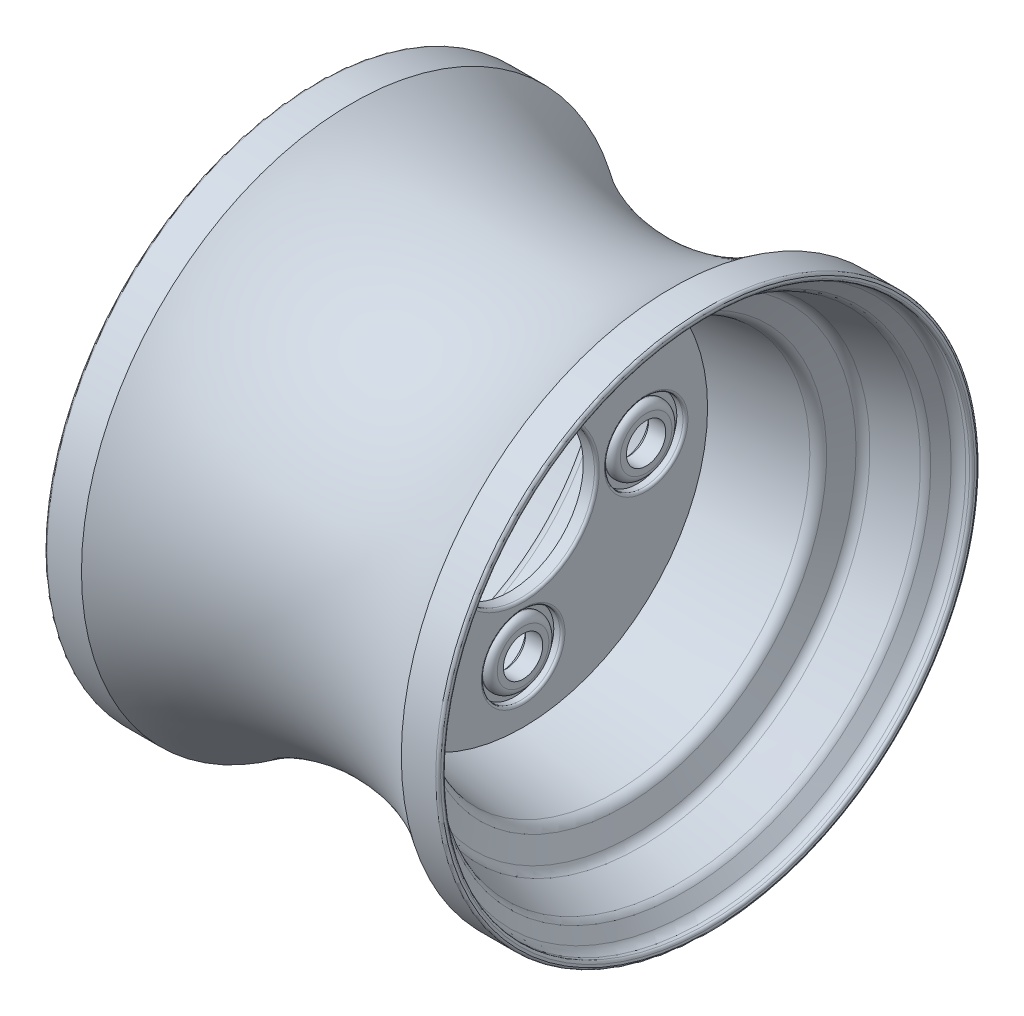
ISO-10303-21;
HEADER;
FILE_DESCRIPTION(('STEP AP214'),'2;1');
FILE_NAME('part.step','',(''),(''),'','','');
FILE_SCHEMA(('AUTOMOTIVE_DESIGN { 1 0 10303 214 1 1 1 1 }'));
ENDSEC;
DATA;
#1=APPLICATION_CONTEXT('core data for automotive mechanical design processes');
#2=APPLICATION_PROTOCOL_DEFINITION('international standard','automotive_design',2000,#1);
#3=PRODUCT_CONTEXT('',#1,'mechanical');
#4=PRODUCT('Part','Part','',(#3));
#5=PRODUCT_RELATED_PRODUCT_CATEGORY('part','',(#4));
#6=PRODUCT_DEFINITION_FORMATION('','',#4);
#7=PRODUCT_DEFINITION_CONTEXT('part definition',#1,'design');
#8=PRODUCT_DEFINITION('design','',#6,#7);
#9=PRODUCT_DEFINITION_SHAPE('','',#8);
#10=(LENGTH_UNIT() NAMED_UNIT(*) SI_UNIT(.MILLI.,.METRE.));
#11=(NAMED_UNIT(*) PLANE_ANGLE_UNIT() SI_UNIT($,.RADIAN.));
#12=(NAMED_UNIT(*) SI_UNIT($,.STERADIAN.) SOLID_ANGLE_UNIT());
#13=UNCERTAINTY_MEASURE_WITH_UNIT(LENGTH_MEASURE(1.E-05),#10,'distance_accuracy_value','');
#14=(GEOMETRIC_REPRESENTATION_CONTEXT(3) GLOBAL_UNCERTAINTY_ASSIGNED_CONTEXT((#13)) GLOBAL_UNIT_ASSIGNED_CONTEXT((#10,
#11,#12)) REPRESENTATION_CONTEXT('',''));
#15=CARTESIAN_POINT('',(0.,0.,0.));
#16=DIRECTION('',(0.,0.,1.));
#17=DIRECTION('',(1.,0.,0.));
#18=AXIS2_PLACEMENT_3D('',#15,#16,#17);
#19=CARTESIAN_POINT('',(4.49999999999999,75.,0.));
#20=DIRECTION('',(-1.,0.,0.));
#21=DIRECTION('',(0.,0.,1.));
#22=AXIS2_PLACEMENT_3D('',#19,#20,#21);
#23=PLANE('',#22);
#24=CARTESIAN_POINT('',(4.49999999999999,0.,50.));
#25=DIRECTION('',(-1.,0.,0.));
#26=DIRECTION('',(0.,0.,1.));
#27=AXIS2_PLACEMENT_3D('',#24,#25,#26);
#28=CIRCLE('',#27,10.5);
#29=CARTESIAN_POINT('',(4.49999999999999,0.,60.5));
#30=VERTEX_POINT('',#29);
#31=EDGE_CURVE('E258',#30,#30,#28,.F.);
#32=ORIENTED_EDGE('',*,*,#31,.T.);
#33=EDGE_LOOP('',(#32));
#34=FACE_BOUND('',#33,.T.);
#35=CARTESIAN_POINT('',(4.49999999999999,0.,50.));
#36=DIRECTION('',(-1.,0.,0.));
#37=DIRECTION('',(0.,0.,1.));
#38=AXIS2_PLACEMENT_3D('',#35,#36,#37);
#39=CIRCLE('',#38,8.);
#40=CARTESIAN_POINT('',(4.49999999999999,0.,58.));
#41=VERTEX_POINT('',#40);
#42=EDGE_CURVE('E171',#41,#41,#39,.T.);
#43=ORIENTED_EDGE('',*,*,#42,.T.);
#44=EDGE_LOOP('',(#43));
#45=FACE_BOUND('',#44,.T.);
#46=ADVANCED_FACE('F32',(#34,#45),#23,.F.);
#47=CARTESIAN_POINT('',(4.49999999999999,-50.,0.));
#48=DIRECTION('',(-1.,0.,0.));
#49=DIRECTION('',(0.,0.,1.));
#50=AXIS2_PLACEMENT_3D('',#47,#48,#49);
#51=CIRCLE('',#50,10.5);
#52=CARTESIAN_POINT('',(4.49999999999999,-50.,10.5));
#53=VERTEX_POINT('',#52);
#54=EDGE_CURVE('E240',#53,#53,#51,.F.);
#55=ORIENTED_EDGE('',*,*,#54,.T.);
#56=EDGE_LOOP('',(#55));
#57=FACE_BOUND('',#56,.T.);
#58=CARTESIAN_POINT('',(4.49999999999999,-50.,0.));
#59=DIRECTION('',(-1.,0.,0.));
#60=DIRECTION('',(0.,0.,1.));
#61=AXIS2_PLACEMENT_3D('',#58,#59,#60);
#62=CIRCLE('',#61,8.);
#63=CARTESIAN_POINT('',(4.49999999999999,-50.,8.));
#64=VERTEX_POINT('',#63);
#65=EDGE_CURVE('E165',#64,#64,#62,.T.);
#66=ORIENTED_EDGE('',*,*,#65,.T.);
#67=EDGE_LOOP('',(#66));
#68=FACE_BOUND('',#67,.T.);
#69=ADVANCED_FACE('F444',(#57,#68),#23,.F.);
#70=CARTESIAN_POINT('',(4.49999999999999,0.,-50.));
#71=DIRECTION('',(-1.,0.,0.));
#72=DIRECTION('',(0.,0.,1.));
#73=AXIS2_PLACEMENT_3D('',#70,#71,#72);
#74=CIRCLE('',#73,10.5);
#75=CARTESIAN_POINT('',(4.49999999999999,0.,-39.5));
#76=VERTEX_POINT('',#75);
#77=EDGE_CURVE('E246',#76,#76,#74,.F.);
#78=ORIENTED_EDGE('',*,*,#77,.T.);
#79=EDGE_LOOP('',(#78));
#80=FACE_BOUND('',#79,.T.);
#81=CARTESIAN_POINT('',(4.49999999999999,0.,-50.));
#82=DIRECTION('',(-1.,0.,0.));
#83=DIRECTION('',(0.,0.,1.));
#84=AXIS2_PLACEMENT_3D('',#81,#82,#83);
#85=CIRCLE('',#84,8.);
#86=CARTESIAN_POINT('',(4.49999999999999,0.,-42.));
#87=VERTEX_POINT('',#86);
#88=EDGE_CURVE('E168',#87,#87,#85,.T.);
#89=ORIENTED_EDGE('',*,*,#88,.T.);
#90=EDGE_LOOP('',(#89));
#91=FACE_BOUND('',#90,.T.);
#92=ADVANCED_FACE('F449',(#80,#91),#23,.F.);
#93=CARTESIAN_POINT('',(4.49999999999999,50.,0.));
#94=DIRECTION('',(-1.,0.,0.));
#95=DIRECTION('',(0.,0.,1.));
#96=AXIS2_PLACEMENT_3D('',#93,#94,#95);
#97=CIRCLE('',#96,10.5);
#98=CARTESIAN_POINT('',(4.49999999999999,50.,10.5));
#99=VERTEX_POINT('',#98);
#100=EDGE_CURVE('E252',#99,#99,#97,.F.);
#101=ORIENTED_EDGE('',*,*,#100,.T.);
#102=EDGE_LOOP('',(#101));
#103=FACE_BOUND('',#102,.T.);
#104=CARTESIAN_POINT('',(4.49999999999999,50.,0.));
#105=DIRECTION('',(-1.,0.,0.));
#106=DIRECTION('',(0.,0.,1.));
#107=AXIS2_PLACEMENT_3D('',#104,#105,#106);
#108=CIRCLE('',#107,8.);
#109=CARTESIAN_POINT('',(4.49999999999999,50.,8.));
#110=VERTEX_POINT('',#109);
#111=EDGE_CURVE('E161',#110,#110,#108,.T.);
#112=ORIENTED_EDGE('',*,*,#111,.T.);
#113=EDGE_LOOP('',(#112));
#114=FACE_BOUND('',#113,.T.);
#115=ADVANCED_FACE('F359',(#103,#114),#23,.F.);
#116=CARTESIAN_POINT('',(-4.50000000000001,31.,0.));
#117=DIRECTION('',(1.,0.,0.));
#118=DIRECTION('',(0.,0.,-1.));
#119=AXIS2_PLACEMENT_3D('',#116,#117,#118);
#120=PLANE('',#119);
#121=CARTESIAN_POINT('',(-4.50000000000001,0.,-50.));
#122=DIRECTION('',(1.,0.,0.));
#123=DIRECTION('',(0.,0.,-1.));
#124=AXIS2_PLACEMENT_3D('',#121,#122,#123);
#125=CIRCLE('',#124,10.);
#126=CARTESIAN_POINT('',(-4.50000000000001,0.,-60.));
#127=VERTEX_POINT('',#126);
#128=EDGE_CURVE('E195',#127,#127,#125,.T.);
#129=ORIENTED_EDGE('',*,*,#128,.T.);
#130=EDGE_LOOP('',(#129));
#131=FACE_BOUND('',#130,.T.);
#132=CARTESIAN_POINT('',(-4.50000000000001,0.,-50.));
#133=DIRECTION('',(1.,0.,0.));
#134=DIRECTION('',(0.,0.,-1.));
#135=AXIS2_PLACEMENT_3D('',#132,#133,#134);
#136=CIRCLE('',#135,11.2303039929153);
#137=CARTESIAN_POINT('',(-4.50000000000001,0.,-61.2303039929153));
#138=VERTEX_POINT('',#137);
#139=EDGE_CURVE('E180',#138,#138,#136,.F.);
#140=ORIENTED_EDGE('',*,*,#139,.T.);
#141=EDGE_LOOP('',(#140));
#142=FACE_BOUND('',#141,.T.);
#143=ADVANCED_FACE('F368',(#131,#142),#120,.F.);
#144=CARTESIAN_POINT('',(-4.50000000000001,50.,0.));
#145=DIRECTION('',(1.,0.,0.));
#146=DIRECTION('',(0.,0.,-1.));
#147=AXIS2_PLACEMENT_3D('',#144,#145,#146);
#148=CIRCLE('',#147,10.);
#149=CARTESIAN_POINT('',(-4.50000000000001,50.,-10.));
#150=VERTEX_POINT('',#149);
#151=EDGE_CURVE('E213',#150,#150,#148,.T.);
#152=ORIENTED_EDGE('',*,*,#151,.T.);
#153=EDGE_LOOP('',(#152));
#154=FACE_BOUND('',#153,.T.);
#155=CARTESIAN_POINT('',(-4.50000000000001,50.,0.));
#156=DIRECTION('',(1.,0.,0.));
#157=DIRECTION('',(0.,0.,-1.));
#158=AXIS2_PLACEMENT_3D('',#155,#156,#157);
#159=CIRCLE('',#158,11.2303039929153);
#160=CARTESIAN_POINT('',(-4.50000000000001,50.,-11.2303039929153));
#161=VERTEX_POINT('',#160);
#162=EDGE_CURVE('E183',#161,#161,#159,.F.);
#163=ORIENTED_EDGE('',*,*,#162,.T.);
#164=EDGE_LOOP('',(#163));
#165=FACE_BOUND('',#164,.T.);
#166=ADVANCED_FACE('F371',(#154,#165),#120,.F.);
#167=CARTESIAN_POINT('',(-4.50000000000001,0.,50.));
#168=DIRECTION('',(1.,0.,0.));
#169=DIRECTION('',(0.,0.,-1.));
#170=AXIS2_PLACEMENT_3D('',#167,#168,#169);
#171=CIRCLE('',#170,10.);
#172=CARTESIAN_POINT('',(-4.50000000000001,0.,40.));
#173=VERTEX_POINT('',#172);
#174=EDGE_CURVE('E207',#173,#173,#171,.T.);
#175=ORIENTED_EDGE('',*,*,#174,.T.);
#176=EDGE_LOOP('',(#175));
#177=FACE_BOUND('',#176,.T.);
#178=CARTESIAN_POINT('',(-4.50000000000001,0.,50.));
#179=DIRECTION('',(1.,0.,0.));
#180=DIRECTION('',(0.,0.,-1.));
#181=AXIS2_PLACEMENT_3D('',#178,#179,#180);
#182=CIRCLE('',#181,11.2303039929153);
#183=CARTESIAN_POINT('',(-4.50000000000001,0.,38.7696960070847));
#184=VERTEX_POINT('',#183);
#185=EDGE_CURVE('E160',#184,#184,#182,.F.);
#186=ORIENTED_EDGE('',*,*,#185,.T.);
#187=EDGE_LOOP('',(#186));
#188=FACE_BOUND('',#187,.T.);
#189=ADVANCED_FACE('F783',(#177,#188),#120,.F.);
#190=CARTESIAN_POINT('',(-4.50000000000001,-50.,0.));
#191=DIRECTION('',(1.,0.,0.));
#192=DIRECTION('',(0.,0.,-1.));
#193=AXIS2_PLACEMENT_3D('',#190,#191,#192);
#194=CIRCLE('',#193,10.);
#195=CARTESIAN_POINT('',(-4.50000000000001,-50.,-10.));
#196=VERTEX_POINT('',#195);
#197=EDGE_CURVE('E201',#196,#196,#194,.T.);
#198=ORIENTED_EDGE('',*,*,#197,.T.);
#199=EDGE_LOOP('',(#198));
#200=FACE_BOUND('',#199,.T.);
#201=CARTESIAN_POINT('',(-4.50000000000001,-50.,0.));
#202=DIRECTION('',(1.,0.,0.));
#203=DIRECTION('',(0.,0.,-1.));
#204=AXIS2_PLACEMENT_3D('',#201,#202,#203);
#205=CIRCLE('',#204,11.2303039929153);
#206=CARTESIAN_POINT('',(-4.50000000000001,-50.,-11.2303039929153));
#207=VERTEX_POINT('',#206);
#208=EDGE_CURVE('E177',#207,#207,#205,.F.);
#209=ORIENTED_EDGE('',*,*,#208,.T.);
#210=EDGE_LOOP('',(#209));
#211=FACE_BOUND('',#210,.T.);
#212=ADVANCED_FACE('F366',(#200,#211),#120,.F.);
#213=CARTESIAN_POINT('',(-80.,0.,0.));
#214=DIRECTION('',(-1.,0.,0.));
#215=DIRECTION('',(0.,0.,1.));
#216=AXIS2_PLACEMENT_3D('',#213,#214,#215);
#217=CYLINDRICAL_SURFACE('',#216,30.);
#218=CARTESIAN_POINT('',(3.49999999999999,0.,0.));
#219=DIRECTION('',(-1.,0.,0.));
#220=DIRECTION('',(0.,0.,1.));
#221=AXIS2_PLACEMENT_3D('',#218,#219,#220);
#222=CIRCLE('',#221,30.);
#223=CARTESIAN_POINT('',(3.49999999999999,0.,30.));
#224=VERTEX_POINT('',#223);
#225=EDGE_CURVE('E157',#224,#224,#222,.T.);
#226=ORIENTED_EDGE('',*,*,#225,.F.);
#227=EDGE_LOOP('',(#226));
#228=FACE_BOUND('',#227,.T.);
#229=CARTESIAN_POINT('',(-1.00000000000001,0.,0.));
#230=DIRECTION('',(-1.,0.,0.));
#231=DIRECTION('',(0.,0.,1.));
#232=AXIS2_PLACEMENT_3D('',#229,#230,#231);
#233=CIRCLE('',#232,30.);
#234=CARTESIAN_POINT('',(-1.00000000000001,0.,30.));
#235=VERTEX_POINT('',#234);
#236=EDGE_CURVE('E687',#235,#235,#233,.T.);
#237=ORIENTED_EDGE('',*,*,#236,.T.);
#238=EDGE_LOOP('',(#237));
#239=FACE_BOUND('',#238,.T.);
#240=ADVANCED_FACE('F362',(#228,#239),#217,.F.);
#241=CARTESIAN_POINT('',(3.49999999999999,0.,0.));
#242=DIRECTION('',(-1.,0.,0.));
#243=DIRECTION('',(0.,0.,1.));
#244=AXIS2_PLACEMENT_3D('',#241,#242,#243);
#245=TOROIDAL_SURFACE('',#244,31.,1.);
#246=CARTESIAN_POINT('',(4.49999999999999,0.,0.));
#247=DIRECTION('',(-1.,0.,0.));
#248=DIRECTION('',(0.,0.,1.));
#249=AXIS2_PLACEMENT_3D('',#246,#247,#248);
#250=CIRCLE('',#249,31.);
#251=CARTESIAN_POINT('',(4.49999999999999,0.,31.));
#252=VERTEX_POINT('',#251);
#253=EDGE_CURVE('E154',#252,#252,#250,.T.);
#254=ORIENTED_EDGE('',*,*,#253,.F.);
#255=EDGE_LOOP('',(#254));
#256=FACE_BOUND('',#255,.T.);
#257=ORIENTED_EDGE('',*,*,#225,.T.);
#258=EDGE_LOOP('',(#257));
#259=FACE_BOUND('',#258,.T.);
#260=ADVANCED_FACE('F357',(#256,#259),#245,.T.);
#261=CARTESIAN_POINT('',(4.49999999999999,-50.,0.));
#262=DIRECTION('',(-1.,0.,0.));
#263=DIRECTION('',(0.,0.,1.));
#264=AXIS2_PLACEMENT_3D('',#261,#262,#263);
#265=CIRCLE('',#264,17.);
#266=CARTESIAN_POINT('',(4.49999999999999,-50.,17.));
#267=VERTEX_POINT('',#266);
#268=EDGE_CURVE('E228',#267,#267,#265,.T.);
#269=ORIENTED_EDGE('',*,*,#268,.T.);
#270=EDGE_LOOP('',(#269));
#271=FACE_BOUND('',#270,.T.);
#272=CARTESIAN_POINT('',(4.49999999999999,0.,50.));
#273=DIRECTION('',(-1.,0.,0.));
#274=DIRECTION('',(0.,0.,1.));
#275=AXIS2_PLACEMENT_3D('',#272,#273,#274);
#276=CIRCLE('',#275,17.);
#277=CARTESIAN_POINT('',(4.49999999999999,0.,67.));
#278=VERTEX_POINT('',#277);
#279=EDGE_CURVE('E225',#278,#278,#276,.T.);
#280=ORIENTED_EDGE('',*,*,#279,.T.);
#281=EDGE_LOOP('',(#280));
#282=FACE_BOUND('',#281,.T.);
#283=CARTESIAN_POINT('',(4.49999999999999,0.,-50.));
#284=DIRECTION('',(-1.,0.,0.));
#285=DIRECTION('',(0.,0.,1.));
#286=AXIS2_PLACEMENT_3D('',#283,#284,#285);
#287=CIRCLE('',#286,17.);
#288=CARTESIAN_POINT('',(4.49999999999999,0.,-33.));
#289=VERTEX_POINT('',#288);
#290=EDGE_CURVE('E222',#289,#289,#287,.T.);
#291=ORIENTED_EDGE('',*,*,#290,.T.);
#292=EDGE_LOOP('',(#291));
#293=FACE_BOUND('',#292,.T.);
#294=CARTESIAN_POINT('',(4.49999999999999,50.,0.));
#295=DIRECTION('',(-1.,0.,0.));
#296=DIRECTION('',(0.,0.,1.));
#297=AXIS2_PLACEMENT_3D('',#294,#295,#296);
#298=CIRCLE('',#297,17.);
#299=CARTESIAN_POINT('',(4.49999999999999,50.,17.));
#300=VERTEX_POINT('',#299);
#301=EDGE_CURVE('E219',#300,#300,#298,.T.);
#302=ORIENTED_EDGE('',*,*,#301,.T.);
#303=EDGE_LOOP('',(#302));
#304=FACE_BOUND('',#303,.T.);
#305=CARTESIAN_POINT('',(4.49999999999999,0.,0.));
#306=DIRECTION('',(-1.,0.,0.));
#307=DIRECTION('',(0.,0.,1.));
#308=AXIS2_PLACEMENT_3D('',#305,#306,#307);
#309=CIRCLE('',#308,75.);
#310=CARTESIAN_POINT('',(4.49999999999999,0.,75.));
#311=VERTEX_POINT('',#310);
#312=EDGE_CURVE('E151',#311,#311,#309,.T.);
#313=ORIENTED_EDGE('',*,*,#312,.F.);
#314=EDGE_LOOP('',(#313));
#315=FACE_BOUND('',#314,.T.);
#316=ORIENTED_EDGE('',*,*,#253,.T.);
#317=EDGE_LOOP('',(#316));
#318=FACE_BOUND('',#317,.T.);
#319=ADVANCED_FACE('F353',(#271,#282,#293,#304,#315,#318),#23,.F.);
#320=CARTESIAN_POINT('',(8.87500000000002,0.,0.));
#321=DIRECTION('',(1.,0.,0.));
#322=DIRECTION('',(0.,0.,-1.));
#323=AXIS2_PLACEMENT_3D('',#320,#321,#322);
#324=CONICAL_SURFACE('',#323,75.5511981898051,0.125327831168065);
#325=CARTESIAN_POINT('',(41.420416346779,0.,0.));
#326=DIRECTION('',(-1.,0.,0.));
#327=DIRECTION('',(0.,0.,1.));
#328=AXIS2_PLACEMENT_3D('',#325,#326,#327);
#329=CIRCLE('',#328,79.6515352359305);
#330=CARTESIAN_POINT('',(41.420416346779,0.,79.6515352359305));
#331=VERTEX_POINT('',#330);
#332=EDGE_CURVE('E148',#331,#331,#329,.T.);
#333=ORIENTED_EDGE('',*,*,#332,.F.);
#334=EDGE_LOOP('',(#333));
#335=FACE_BOUND('',#334,.T.);
#336=ORIENTED_EDGE('',*,*,#312,.T.);
#337=EDGE_LOOP('',(#336));
#338=FACE_BOUND('',#337,.T.);
#339=ADVANCED_FACE('F349',(#335,#338),#324,.F.);
#340=CARTESIAN_POINT('',(40.795416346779,0.,0.));
#341=DIRECTION('',(-1.,0.,0.));
#342=DIRECTION('',(0.,0.,1.));
#343=AXIS2_PLACEMENT_3D('',#340,#341,#342);
#344=TOROIDAL_SURFACE('',#343,84.6123189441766,5.);
#345=CARTESIAN_POINT('',(45.343915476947,0.,0.));
#346=DIRECTION('',(-1.,0.,0.));
#347=DIRECTION('',(0.,0.,1.));
#348=AXIS2_PLACEMENT_3D('',#345,#346,#347);
#349=CIRCLE('',#348,82.5359866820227);
#350=CARTESIAN_POINT('',(45.343915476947,0.,82.5359866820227));
#351=VERTEX_POINT('',#350);
#352=EDGE_CURVE('E145',#351,#351,#349,.T.);
#353=ORIENTED_EDGE('',*,*,#352,.F.);
#354=EDGE_LOOP('',(#353));
#355=FACE_BOUND('',#354,.T.);
#356=ORIENTED_EDGE('',*,*,#332,.T.);
#357=EDGE_LOOP('',(#356));
#358=FACE_BOUND('',#357,.T.);
#359=ADVANCED_FACE('F345',(#355,#358),#344,.T.);
#360=CARTESIAN_POINT('',(45.343915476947,0.,0.));
#361=DIRECTION('',(1.,0.,0.));
#362=DIRECTION('',(0.,0.,-1.));
#363=AXIS2_PLACEMENT_3D('',#360,#361,#362);
#364=CONICAL_SURFACE('',#363,82.5359866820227,1.14256064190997);
#365=CARTESIAN_POINT('',(49.0930438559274,0.,0.));
#366=DIRECTION('',(-1.,0.,0.));
#367=DIRECTION('',(0.,0.,1.));
#368=AXIS2_PLACEMENT_3D('',#365,#366,#367);
#369=CIRCLE('',#368,90.7489820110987);
#370=CARTESIAN_POINT('',(49.0930438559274,0.,90.7489820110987));
#371=VERTEX_POINT('',#370);
#372=EDGE_CURVE('E142',#371,#371,#369,.T.);
#373=ORIENTED_EDGE('',*,*,#372,.F.);
#374=EDGE_LOOP('',(#373));
#375=FACE_BOUND('',#374,.T.);
#376=ORIENTED_EDGE('',*,*,#352,.T.);
#377=EDGE_LOOP('',(#376));
#378=FACE_BOUND('',#377,.T.);
#379=ADVANCED_FACE('F341',(#375,#378),#364,.F.);
#380=CARTESIAN_POINT('',(53.6415429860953,0.,0.));
#381=DIRECTION('',(-1.,0.,0.));
#382=DIRECTION('',(0.,0.,1.));
#383=AXIS2_PLACEMENT_3D('',#380,#381,#382);
#384=TOROIDAL_SURFACE('',#383,88.6726497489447,5.);
#385=CARTESIAN_POINT('',(52.0739146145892,0.,0.));
#386=DIRECTION('',(-1.,0.,0.));
#387=DIRECTION('',(0.,0.,1.));
#388=AXIS2_PLACEMENT_3D('',#385,#386,#387);
#389=CIRCLE('',#388,93.4205483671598);
#390=CARTESIAN_POINT('',(52.0739146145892,0.,93.4205483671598));
#391=VERTEX_POINT('',#390);
#392=EDGE_CURVE('E139',#391,#391,#389,.T.);
#393=ORIENTED_EDGE('',*,*,#392,.F.);
#394=EDGE_LOOP('',(#393));
#395=FACE_BOUND('',#394,.T.);
#396=ORIENTED_EDGE('',*,*,#372,.T.);
#397=EDGE_LOOP('',(#396));
#398=FACE_BOUND('',#397,.T.);
#399=ADVANCED_FACE('F337',(#395,#398),#384,.F.);
#400=CARTESIAN_POINT('',(52.0739146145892,0.,0.));
#401=DIRECTION('',(1.,0.,0.));
#402=DIRECTION('',(0.,0.,-1.));
#403=AXIS2_PLACEMENT_3D('',#400,#401,#402);
#404=CONICAL_SURFACE('',#403,93.4205483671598,0.31890364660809);
#405=CARTESIAN_POINT('',(67.5037821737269,0.,0.));
#406=DIRECTION('',(-1.,0.,0.));
#407=DIRECTION('',(0.,0.,1.));
#408=AXIS2_PLACEMENT_3D('',#405,#406,#407);
#409=CIRCLE('',#408,98.5150754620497);
#410=CARTESIAN_POINT('',(67.5037821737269,0.,98.5150754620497));
#411=VERTEX_POINT('',#410);
#412=EDGE_CURVE('E136',#411,#411,#409,.T.);
#413=ORIENTED_EDGE('',*,*,#412,.F.);
#414=EDGE_LOOP('',(#413));
#415=FACE_BOUND('',#414,.T.);
#416=ORIENTED_EDGE('',*,*,#392,.T.);
#417=EDGE_LOOP('',(#416));
#418=FACE_BOUND('',#417,.T.);
#419=ADVANCED_FACE('F333',(#415,#418),#404,.F.);
#420=CARTESIAN_POINT('',(65.9361538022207,0.,0.));
#421=DIRECTION('',(-1.,0.,0.));
#422=DIRECTION('',(0.,0.,1.));
#423=AXIS2_PLACEMENT_3D('',#420,#421,#422);
#424=TOROIDAL_SURFACE('',#423,103.262974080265,5.00000000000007);
#425=CARTESIAN_POINT('',(69.9329982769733,0.,0.));
#426=DIRECTION('',(-1.,0.,0.));
#427=DIRECTION('',(0.,0.,1.));
#428=AXIS2_PLACEMENT_3D('',#425,#426,#427);
#429=CIRCLE('',#428,100.258771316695);
#430=CARTESIAN_POINT('',(69.9329982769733,0.,100.258771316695));
#431=VERTEX_POINT('',#430);
#432=EDGE_CURVE('E133',#431,#431,#429,.T.);
#433=ORIENTED_EDGE('',*,*,#432,.F.);
#434=EDGE_LOOP('',(#433));
#435=FACE_BOUND('',#434,.T.);
#436=ORIENTED_EDGE('',*,*,#412,.T.);
#437=EDGE_LOOP('',(#436));
#438=FACE_BOUND('',#437,.T.);
#439=ADVANCED_FACE('F329',(#435,#438),#424,.T.);
#440=CARTESIAN_POINT('',(69.9329982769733,0.,0.));
#441=DIRECTION('',(1.,0.,0.));
#442=DIRECTION('',(0.,0.,-1.));
#443=AXIS2_PLACEMENT_3D('',#440,#441,#442);
#444=CONICAL_SURFACE('',#443,100.258771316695,0.926244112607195);
#445=CARTESIAN_POINT('',(73.4998716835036,0.,0.));
#446=DIRECTION('',(-1.,0.,0.));
#447=DIRECTION('',(0.,0.,1.));
#448=AXIS2_PLACEMENT_3D('',#445,#446,#447);
#449=CIRCLE('',#448,105.00420276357);
#450=CARTESIAN_POINT('',(73.4998716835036,0.,105.00420276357));
#451=VERTEX_POINT('',#450);
#452=EDGE_CURVE('E130',#451,#451,#449,.T.);
#453=ORIENTED_EDGE('',*,*,#452,.F.);
#454=EDGE_LOOP('',(#453));
#455=FACE_BOUND('',#454,.T.);
#456=ORIENTED_EDGE('',*,*,#432,.T.);
#457=EDGE_LOOP('',(#456));
#458=FACE_BOUND('',#457,.T.);
#459=ADVANCED_FACE('F325',(#455,#458),#444,.F.);
#460=CARTESIAN_POINT('',(77.496716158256,0.,0.));
#461=DIRECTION('',(-1.,0.,0.));
#462=DIRECTION('',(0.,0.,1.));
#463=AXIS2_PLACEMENT_3D('',#460,#461,#462);
#464=TOROIDAL_SURFACE('',#463,102.,4.99999999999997);
#465=CARTESIAN_POINT('',(77.496716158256,0.,0.));
#466=DIRECTION('',(-1.,0.,0.));
#467=DIRECTION('',(0.,0.,1.));
#468=AXIS2_PLACEMENT_3D('',#465,#466,#467);
#469=CIRCLE('',#468,107.);
#470=CARTESIAN_POINT('',(77.496716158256,0.,107.));
#471=VERTEX_POINT('',#470);
#472=EDGE_CURVE('E127',#471,#471,#469,.T.);
#473=ORIENTED_EDGE('',*,*,#472,.F.);
#474=EDGE_LOOP('',(#473));
#475=FACE_BOUND('',#474,.T.);
#476=ORIENTED_EDGE('',*,*,#452,.T.);
#477=EDGE_LOOP('',(#476));
#478=FACE_BOUND('',#477,.T.);
#479=ADVANCED_FACE('F321',(#475,#478),#464,.F.);
#480=CARTESIAN_POINT('',(-80.,0.,0.));
#481=DIRECTION('',(-1.,0.,0.));
#482=DIRECTION('',(0.,0.,1.));
#483=AXIS2_PLACEMENT_3D('',#480,#481,#482);
#484=CYLINDRICAL_SURFACE('',#483,107.);
#485=CARTESIAN_POINT('',(79.,0.,0.));
#486=DIRECTION('',(-1.,0.,0.));
#487=DIRECTION('',(0.,0.,1.));
#488=AXIS2_PLACEMENT_3D('',#485,#486,#487);
#489=CIRCLE('',#488,107.);
#490=CARTESIAN_POINT('',(79.,0.,107.));
#491=VERTEX_POINT('',#490);
#492=EDGE_CURVE('E124',#491,#491,#489,.T.);
#493=ORIENTED_EDGE('',*,*,#492,.F.);
#494=EDGE_LOOP('',(#493));
#495=FACE_BOUND('',#494,.T.);
#496=ORIENTED_EDGE('',*,*,#472,.T.);
#497=EDGE_LOOP('',(#496));
#498=FACE_BOUND('',#497,.T.);
#499=ADVANCED_FACE('F317',(#495,#498),#484,.F.);
#500=CARTESIAN_POINT('',(79.,0.,0.));
#501=DIRECTION('',(-1.,0.,0.));
#502=DIRECTION('',(0.,0.,1.));
#503=AXIS2_PLACEMENT_3D('',#500,#501,#502);
#504=TOROIDAL_SURFACE('',#503,108.,1.);
#505=CARTESIAN_POINT('',(80.,0.,0.));
#506=DIRECTION('',(-1.,0.,0.));
#507=DIRECTION('',(0.,0.,1.));
#508=AXIS2_PLACEMENT_3D('',#505,#506,#507);
#509=CIRCLE('',#508,108.);
#510=CARTESIAN_POINT('',(80.,0.,108.));
#511=VERTEX_POINT('',#510);
#512=EDGE_CURVE('E121',#511,#511,#509,.T.);
#513=ORIENTED_EDGE('',*,*,#512,.F.);
#514=EDGE_LOOP('',(#513));
#515=FACE_BOUND('',#514,.T.);
#516=ORIENTED_EDGE('',*,*,#492,.T.);
#517=EDGE_LOOP('',(#516));
#518=FACE_BOUND('',#517,.T.);
#519=ADVANCED_FACE('F313',(#515,#518),#504,.T.);
#520=CARTESIAN_POINT('',(80.,108.,0.));
#521=DIRECTION('',(-1.,0.,0.));
#522=DIRECTION('',(0.,0.,1.));
#523=AXIS2_PLACEMENT_3D('',#520,#521,#522);
#524=PLANE('',#523);
#525=CARTESIAN_POINT('',(80.,0.,0.));
#526=DIRECTION('',(-1.,0.,0.));
#527=DIRECTION('',(0.,0.,1.));
#528=AXIS2_PLACEMENT_3D('',#525,#526,#527);
#529=CIRCLE('',#528,109.);
#530=CARTESIAN_POINT('',(80.,0.,109.));
#531=VERTEX_POINT('',#530);
#532=EDGE_CURVE('E118',#531,#531,#529,.T.);
#533=ORIENTED_EDGE('',*,*,#532,.F.);
#534=EDGE_LOOP('',(#533));
#535=FACE_BOUND('',#534,.T.);
#536=ORIENTED_EDGE('',*,*,#512,.T.);
#537=EDGE_LOOP('',(#536));
#538=FACE_BOUND('',#537,.T.);
#539=ADVANCED_FACE('F309',(#535,#538),#524,.F.);
#540=CARTESIAN_POINT('',(79.,0.,0.));
#541=DIRECTION('',(-1.,0.,0.));
#542=DIRECTION('',(0.,0.,1.));
#543=AXIS2_PLACEMENT_3D('',#540,#541,#542);
#544=TOROIDAL_SURFACE('',#543,109.,1.);
#545=CARTESIAN_POINT('',(79.,0.,0.));
#546=DIRECTION('',(-1.,0.,0.));
#547=DIRECTION('',(0.,0.,1.));
#548=AXIS2_PLACEMENT_3D('',#545,#546,#547);
#549=CIRCLE('',#548,110.);
#550=CARTESIAN_POINT('',(79.,0.,110.));
#551=VERTEX_POINT('',#550);
#552=EDGE_CURVE('E115',#551,#551,#549,.T.);
#553=ORIENTED_EDGE('',*,*,#552,.F.);
#554=EDGE_LOOP('',(#553));
#555=FACE_BOUND('',#554,.T.);
#556=ORIENTED_EDGE('',*,*,#532,.T.);
#557=EDGE_LOOP('',(#556));
#558=FACE_BOUND('',#557,.T.);
#559=ADVANCED_FACE('F305',(#555,#558),#544,.T.);
#560=CARTESIAN_POINT('',(-80.,0.,0.));
#561=DIRECTION('',(-1.,0.,0.));
#562=DIRECTION('',(0.,0.,1.));
#563=AXIS2_PLACEMENT_3D('',#560,#561,#562);
#564=CYLINDRICAL_SURFACE('',#563,110.);
#565=CARTESIAN_POINT('',(64.9999999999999,0.,0.));
#566=DIRECTION('',(-1.,0.,0.));
#567=DIRECTION('',(0.,0.,1.));
#568=AXIS2_PLACEMENT_3D('',#565,#566,#567);
#569=CIRCLE('',#568,110.);
#570=CARTESIAN_POINT('',(64.9999999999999,0.,110.));
#571=VERTEX_POINT('',#570);
#572=EDGE_CURVE('E112',#571,#571,#569,.T.);
#573=ORIENTED_EDGE('',*,*,#572,.F.);
#574=EDGE_LOOP('',(#573));
#575=FACE_BOUND('',#574,.T.);
#576=ORIENTED_EDGE('',*,*,#552,.T.);
#577=EDGE_LOOP('',(#576));
#578=FACE_BOUND('',#577,.T.);
#579=ADVANCED_FACE('F301',(#575,#578),#564,.T.);
#580=CARTESIAN_POINT('',(0.,0.,0.));
#581=DIRECTION('',(-1.,0.,0.));
#582=DIRECTION('',(0.,0.,1.));
#583=AXIS2_PLACEMENT_3D('',#580,#581,#582);
#584=TOROIDAL_SURFACE('',#583,203.247252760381,113.66639849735);
#585=CARTESIAN_POINT('',(-65.,0.,0.));
#586=DIRECTION('',(-1.,0.,0.));
#587=DIRECTION('',(0.,0.,1.));
#588=AXIS2_PLACEMENT_3D('',#585,#586,#587);
#589=CIRCLE('',#588,110.);
#590=CARTESIAN_POINT('',(-65.,0.,110.));
#591=VERTEX_POINT('',#590);
#592=EDGE_CURVE('E104',#591,#591,#589,.T.);
#593=ORIENTED_EDGE('',*,*,#592,.F.);
#594=EDGE_LOOP('',(#593));
#595=FACE_BOUND('',#594,.T.);
#596=ORIENTED_EDGE('',*,*,#572,.T.);
#597=EDGE_LOOP('',(#596));
#598=FACE_BOUND('',#597,.T.);
#599=ADVANCED_FACE('F297',(#595,#598),#584,.F.);
#600=CARTESIAN_POINT('',(-80.,0.,0.));
#601=DIRECTION('',(-1.,0.,0.));
#602=DIRECTION('',(0.,0.,1.));
#603=AXIS2_PLACEMENT_3D('',#600,#601,#602);
#604=CYLINDRICAL_SURFACE('',#603,110.);
#605=CARTESIAN_POINT('',(-79.,0.,0.));
#606=DIRECTION('',(-1.,0.,0.));
#607=DIRECTION('',(0.,0.,1.));
#608=AXIS2_PLACEMENT_3D('',#605,#606,#607);
#609=CIRCLE('',#608,110.);
#610=CARTESIAN_POINT('',(-79.,0.,110.));
#611=VERTEX_POINT('',#610);
#612=EDGE_CURVE('E101',#611,#611,#609,.T.);
#613=ORIENTED_EDGE('',*,*,#612,.F.);
#614=EDGE_LOOP('',(#613));
#615=FACE_BOUND('',#614,.T.);
#616=ORIENTED_EDGE('',*,*,#592,.T.);
#617=EDGE_LOOP('',(#616));
#618=FACE_BOUND('',#617,.T.);
#619=ADVANCED_FACE('F293',(#615,#618),#604,.T.);
#620=CARTESIAN_POINT('',(-79.,0.,0.));
#621=DIRECTION('',(-1.,0.,0.));
#622=DIRECTION('',(0.,0.,1.));
#623=AXIS2_PLACEMENT_3D('',#620,#621,#622);
#624=TOROIDAL_SURFACE('',#623,109.,1.);
#625=CARTESIAN_POINT('',(-79.9999,0.,0.));
#626=DIRECTION('',(-1.,0.,0.));
#627=DIRECTION('',(0.,0.,1.));
#628=AXIS2_PLACEMENT_3D('',#625,#626,#627);
#629=CIRCLE('',#628,109.014141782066);
#630=CARTESIAN_POINT('',(-79.9999,-68.6488051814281,-84.6842645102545));
#631=VERTEX_POINT('',#630);
#632=CARTESIAN_POINT('',(-79.9999,-68.6488051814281,84.6842645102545));
#633=VERTEX_POINT('',#632);
#634=EDGE_CURVE('E86',#631,#633,#629,.T.);
#635=ORIENTED_EDGE('',*,*,#634,.F.);
#636=CARTESIAN_POINT('',(-79.7989910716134,-68.6488051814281,-85.4388430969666));
#637=CARTESIAN_POINT('',(-79.8419631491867,-68.6488051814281,-85.3655970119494));
#638=CARTESIAN_POINT('',(-79.8778320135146,-68.6488051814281,-85.288086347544));
#639=CARTESIAN_POINT('',(-79.9358297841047,-68.6488051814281,-85.1279345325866));
#640=CARTESIAN_POINT('',(-79.9579076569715,-68.6488051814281,-85.0452755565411));
#641=CARTESIAN_POINT('',(-79.9880639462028,-68.6488051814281,-84.8808766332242));
#642=CARTESIAN_POINT('',(-79.9966655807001,-68.6488051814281,-84.7992315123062));
#643=CARTESIAN_POINT('',(-80.0017418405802,-68.6488051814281,-84.6356074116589));
#644=CARTESIAN_POINT('',(-79.9982203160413,-68.6488051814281,-84.5536285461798));
#645=CARTESIAN_POINT('',(-79.9777729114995,-68.6488051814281,-84.3804097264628));
#646=CARTESIAN_POINT('',(-79.9591514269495,-68.6488051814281,-84.2893634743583));
#647=CARTESIAN_POINT('',(-79.9059173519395,-68.6488051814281,-84.1120169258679));
#648=CARTESIAN_POINT('',(-79.8713193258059,-68.6488051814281,-84.0257123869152));
#649=CARTESIAN_POINT('',(-79.7981784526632,-68.6488051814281,-83.8859579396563));
#650=CARTESIAN_POINT('',(-79.7638003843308,-68.6488051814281,-83.8303192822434));
#651=CARTESIAN_POINT('',(-79.6866158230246,-68.6488051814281,-83.7252372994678));
#652=CARTESIAN_POINT('',(-79.6438235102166,-68.6488051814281,-83.6757837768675));
#653=CARTESIAN_POINT('',(-79.5591388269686,-68.6488051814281,-83.5942732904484));
#654=CARTESIAN_POINT('',(-79.5187050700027,-68.6488051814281,-83.560705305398));
#655=CARTESIAN_POINT('',(-79.4328602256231,-68.6488051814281,-83.5006064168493));
#656=CARTESIAN_POINT('',(-79.3874508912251,-68.6488051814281,-83.4740730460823));
#657=CARTESIAN_POINT('',(-79.2921365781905,-68.6488051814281,-83.4294570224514));
#658=CARTESIAN_POINT('',(-79.2421973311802,-68.6488051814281,-83.4114465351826));
#659=CARTESIAN_POINT('',(-79.1397458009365,-68.6488051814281,-83.3856426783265));
#660=CARTESIAN_POINT('',(-79.0872361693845,-68.6488051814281,-83.3778390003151));
#661=CARTESIAN_POINT('',(-78.9891075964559,-68.6488051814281,-83.3734435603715));
#662=CARTESIAN_POINT('',(-78.9435472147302,-68.6488051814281,-83.3754419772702));
#663=CARTESIAN_POINT('',(-78.8534804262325,-68.6488051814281,-83.3873451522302));
#664=CARTESIAN_POINT('',(-78.8089739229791,-68.6488051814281,-83.3972491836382));
#665=CARTESIAN_POINT('',(-78.7236475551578,-68.6488051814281,-83.4238887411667));
#666=CARTESIAN_POINT('',(-78.6827553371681,-68.6488051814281,-83.4403959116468));
#667=CARTESIAN_POINT('',(-78.6039322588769,-68.6488051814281,-83.479356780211));
#668=CARTESIAN_POINT('',(-78.5660019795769,-68.6488051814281,-83.5018116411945));
#669=CARTESIAN_POINT('',(-78.489504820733,-68.6488051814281,-83.554564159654));
#670=CARTESIAN_POINT('',(-78.4513542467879,-68.6488051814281,-83.5854626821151));
#671=CARTESIAN_POINT('',(-78.3796989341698,-68.6488051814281,-83.6522356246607));
#672=CARTESIAN_POINT('',(-78.3461981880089,-68.6488051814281,-83.6881142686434));
#673=CARTESIAN_POINT('',(-78.2687327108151,-68.6488051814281,-83.7822866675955));
#674=CARTESIAN_POINT('',(-78.2276546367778,-68.6488051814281,-83.842966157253));
#675=CARTESIAN_POINT('',(-78.1558982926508,-68.6488051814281,-83.9701846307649));
#676=CARTESIAN_POINT('',(-78.1252364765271,-68.6488051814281,-84.0367326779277));
#677=CARTESIAN_POINT('',(-78.0736337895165,-68.6488051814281,-84.1745768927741));
#678=CARTESIAN_POINT('',(-78.0528417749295,-68.6488051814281,-84.2459283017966));
#679=CARTESIAN_POINT('',(-78.0213577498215,-68.6488051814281,-84.3907866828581));
#680=CARTESIAN_POINT('',(-78.0106657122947,-68.6488051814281,-84.464293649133));
#681=CARTESIAN_POINT('',(-77.9980814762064,-68.6488051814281,-84.6267559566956));
#682=CARTESIAN_POINT('',(-77.9983539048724,-68.6488051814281,-84.7158850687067));
#683=CARTESIAN_POINT('',(-78.0132410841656,-68.6488051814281,-84.8929980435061));
#684=CARTESIAN_POINT('',(-78.0278615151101,-68.6488051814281,-84.9809814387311));
#685=CARTESIAN_POINT('',(-78.0690445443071,-68.6488051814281,-85.1422558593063));
#686=CARTESIAN_POINT('',(-78.0938544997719,-68.6488051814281,-85.2159936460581));
#687=CARTESIAN_POINT('',(-78.1551221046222,-68.6488051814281,-85.3584705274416));
#688=CARTESIAN_POINT('',(-78.1915645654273,-68.6488051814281,-85.4272159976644));
#689=CARTESIAN_POINT('',(-78.2671810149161,-68.6488051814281,-85.5427805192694));
#690=CARTESIAN_POINT('',(-78.3040355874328,-68.6488051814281,-85.591115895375));
#691=CARTESIAN_POINT('',(-78.3850637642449,-68.6488051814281,-85.6812272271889));
#692=CARTESIAN_POINT('',(-78.4292282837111,-68.6488051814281,-85.7230112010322));
#693=CARTESIAN_POINT('',(-78.51604221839,-68.6488051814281,-85.7912780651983));
#694=CARTESIAN_POINT('',(-78.5575883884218,-68.6488051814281,-85.8191597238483));
#695=CARTESIAN_POINT('',(-78.6447386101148,-68.6488051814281,-85.8676864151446));
#696=CARTESIAN_POINT('',(-78.6903406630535,-68.6488051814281,-85.888334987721));
#697=CARTESIAN_POINT('',(-78.7848315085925,-68.6488051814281,-85.9212452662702));
#698=CARTESIAN_POINT('',(-78.8337389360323,-68.6488051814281,-85.9334541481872));
#699=CARTESIAN_POINT('',(-78.9329834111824,-68.6488051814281,-85.9483652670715));
#700=CARTESIAN_POINT('',(-78.9833197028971,-68.6488051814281,-85.9510724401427));
#701=CARTESIAN_POINT('',(-79.0782048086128,-68.6488051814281,-85.9470158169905));
#702=CARTESIAN_POINT('',(-79.1227987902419,-68.6488051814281,-85.9412304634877));
#703=CARTESIAN_POINT('',(-79.2103781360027,-68.6488051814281,-85.9222918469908));
#704=CARTESIAN_POINT('',(-79.2533635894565,-68.6488051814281,-85.909138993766));
#705=CARTESIAN_POINT('',(-79.3369767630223,-68.6488051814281,-85.8760916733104));
#706=CARTESIAN_POINT('',(-79.3775860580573,-68.6488051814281,-85.8561510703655));
#707=CARTESIAN_POINT('',(-79.4554159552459,-68.6488051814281,-85.8104975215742));
#708=CARTESIAN_POINT('',(-79.4926344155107,-68.6488051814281,-85.7847809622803));
#709=CARTESIAN_POINT('',(-79.5679286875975,-68.6488051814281,-85.7248275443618));
#710=CARTESIAN_POINT('',(-79.6054618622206,-68.6488051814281,-85.6899127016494));
#711=CARTESIAN_POINT('',(-79.6753070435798,-68.6488051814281,-85.6152809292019));
#712=CARTESIAN_POINT('',(-79.7076222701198,-68.6488051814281,-85.5755669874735));
#713=CARTESIAN_POINT('',(-79.7593017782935,-68.6488051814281,-85.5032456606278));
#714=CARTESIAN_POINT('',(-79.7798510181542,-68.6488051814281,-85.4714673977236));
#715=CARTESIAN_POINT('',(-79.7989910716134,-68.6488051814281,-85.4388430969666));
#716=B_SPLINE_CURVE_WITH_KNOTS('',3,(#636,#637,#638,#639,#640,#641,#642,#643,#644,#645,#646,
#647,#648,#649,#650,#651,#652,#653,#654,#655,#656,#657,#658,#659,#660,#661,#662,#663,#664,#665,
#666,#667,#668,#669,#670,#671,#672,#673,#674,#675,#676,#677,#678,#679,#680,#681,#682,#683,#684,
#685,#686,#687,#688,#689,#690,#691,#692,#693,#694,#695,#696,#697,#698,#699,#700,#701,#702,#703,
#704,#705,#706,#707,#708,#709,#710,#711,#712,#713,#714,#715),.UNSPECIFIED.,.T.,.F.,(4,2,2,2,2,2,
2,2,2,2,2,2,2,2,2,2,2,2,2,2,2,2,2,2,2,2,2,2,2,2,2,2,2,2,2,2,2,2,2,4),(0.,0.254624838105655,
0.510186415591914,0.755555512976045,1.00084669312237,1.27827233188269,1.55544556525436,
1.75096469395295,1.94615710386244,2.10320149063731,2.26019072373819,2.41848644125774,
2.57662216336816,2.71273959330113,2.84884451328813,2.9806012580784,3.11238378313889,
3.25912250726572,3.40598645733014,3.62461952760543,3.8435963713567,4.06577841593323,
4.28795986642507,4.55418588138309,4.82051733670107,5.05302172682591,5.28522376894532,
5.46690496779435,5.64836204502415,5.79785858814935,5.94728186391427,6.09763211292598,
6.24790424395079,6.38216411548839,6.51641652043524,6.65160027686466,6.78686884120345,
6.94010278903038,7.09324181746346,7.20665343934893),.UNSPECIFIED.);
#717=CARTESIAN_POINT('',(-80.,-68.6488051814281,-84.6660590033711));
#718=VERTEX_POINT('',#717);
#719=EDGE_CURVE('E60',#631,#718,#716,.T.);
#720=ORIENTED_EDGE('',*,*,#719,.T.);
#721=CARTESIAN_POINT('',(-80.,0.,0.));
#722=DIRECTION('',(-1.,0.,0.));
#723=DIRECTION('',(0.,0.,1.));
#724=AXIS2_PLACEMENT_3D('',#721,#722,#723);
#725=CIRCLE('',#724,109.);
#726=CARTESIAN_POINT('',(-80.,-68.6488051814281,84.6660590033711));
#727=VERTEX_POINT('',#726);
#728=EDGE_CURVE('E93',#727,#718,#725,.T.);
#729=ORIENTED_EDGE('',*,*,#728,.F.);
#730=CARTESIAN_POINT('',(-79.8727122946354,-68.6488051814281,84.0365677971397));
#731=CARTESIAN_POINT('',(-79.9063723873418,-68.6488051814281,84.1142590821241));
#732=CARTESIAN_POINT('',(-79.9332140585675,-68.6488051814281,84.1950145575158));
#733=CARTESIAN_POINT('',(-79.9736782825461,-68.6488051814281,84.3599223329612));
#734=CARTESIAN_POINT('',(-79.9872568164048,-68.6488051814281,84.4440849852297));
#735=CARTESIAN_POINT('',(-80.0015691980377,-68.6488051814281,84.616137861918));
#736=CARTESIAN_POINT('',(-80.0018918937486,-68.6488051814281,84.704062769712));
#737=CARTESIAN_POINT('',(-79.9885898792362,-68.6488051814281,84.8788857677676));
#738=CARTESIAN_POINT('',(-79.9749614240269,-68.6488051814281,84.9657835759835));
#739=CARTESIAN_POINT('',(-79.9322781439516,-68.6488051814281,85.1407062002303));
#740=CARTESIAN_POINT('',(-79.9024380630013,-68.6488051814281,85.2285431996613));
#741=CARTESIAN_POINT('',(-79.8261631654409,-68.6488051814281,85.3966978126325));
#742=CARTESIAN_POINT('',(-79.7797705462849,-68.6488051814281,85.4770338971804));
#743=CARTESIAN_POINT('',(-79.6905219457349,-68.6488051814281,85.5974623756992));
#744=CARTESIAN_POINT('',(-79.652803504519,-68.6488051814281,85.6413872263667));
#745=CARTESIAN_POINT('',(-79.5708144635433,-68.6488051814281,85.722628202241));
#746=CARTESIAN_POINT('',(-79.5265538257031,-68.6488051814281,85.7599541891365));
#747=CARTESIAN_POINT('',(-79.4394090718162,-68.6488051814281,85.8209065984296));
#748=CARTESIAN_POINT('',(-79.3973870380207,-68.6488051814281,85.845761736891));
#749=CARTESIAN_POINT('',(-79.3097754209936,-68.6488051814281,85.8881552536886));
#750=CARTESIAN_POINT('',(-79.2641873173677,-68.6488051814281,85.9056966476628));
#751=CARTESIAN_POINT('',(-79.1703416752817,-68.6488051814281,85.9324472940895));
#752=CARTESIAN_POINT('',(-79.1220714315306,-68.6488051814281,85.941612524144));
#753=CARTESIAN_POINT('',(-79.0246692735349,-68.6488051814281,85.9507794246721));
#754=CARTESIAN_POINT('',(-78.9755376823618,-68.6488051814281,85.9507844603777));
#755=CARTESIAN_POINT('',(-78.882617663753,-68.6488051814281,85.9420669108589));
#756=CARTESIAN_POINT('',(-78.8387515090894,-68.6488051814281,85.934142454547));
#757=CARTESIAN_POINT('',(-78.7529180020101,-68.6488051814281,85.9112299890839));
#758=CARTESIAN_POINT('',(-78.7109508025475,-68.6488051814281,85.8962414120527));
#759=CARTESIAN_POINT('',(-78.6287108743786,-68.6488051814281,85.8594866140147));
#760=CARTESIAN_POINT('',(-78.5885182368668,-68.6488051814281,85.837542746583));
#761=CARTESIAN_POINT('',(-78.5117749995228,-68.6488051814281,85.7880440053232));
#762=CARTESIAN_POINT('',(-78.4752255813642,-68.6488051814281,85.7604873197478));
#763=CARTESIAN_POINT('',(-78.4010953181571,-68.6488051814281,85.6964085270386));
#764=CARTESIAN_POINT('',(-78.364139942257,-68.6488051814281,85.6591651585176));
#765=CARTESIAN_POINT('',(-78.2956866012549,-68.6488051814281,85.5799680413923));
#766=CARTESIAN_POINT('',(-78.2641936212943,-68.6488051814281,85.5380100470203));
#767=CARTESIAN_POINT('',(-78.192669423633,-68.6488051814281,85.4291964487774));
#768=CARTESIAN_POINT('',(-78.155938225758,-68.6488051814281,85.3601589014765));
#769=CARTESIAN_POINT('',(-78.0942112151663,-68.6488051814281,85.2170293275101));
#770=CARTESIAN_POINT('',(-78.0692324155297,-68.6488051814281,85.1429301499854));
#771=CARTESIAN_POINT('',(-78.0303900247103,-68.6488051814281,84.9909450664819));
#772=CARTESIAN_POINT('',(-78.0166643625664,-68.6488051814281,84.9130242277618));
#773=CARTESIAN_POINT('',(-78.0005471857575,-68.6488051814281,84.7560314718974));
#774=CARTESIAN_POINT('',(-77.9981581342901,-68.6488051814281,84.6769593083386));
#775=CARTESIAN_POINT('',(-78.0051415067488,-68.6488051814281,84.5067602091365));
#776=CARTESIAN_POINT('',(-78.0164350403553,-68.6488051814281,84.4157058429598));
#777=CARTESIAN_POINT('',(-78.054374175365,-68.6488051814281,84.2368013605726));
#778=CARTESIAN_POINT('',(-78.0810145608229,-68.6488051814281,84.148950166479));
#779=CARTESIAN_POINT('',(-78.1422533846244,-68.6488051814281,83.9991248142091));
#780=CARTESIAN_POINT('',(-78.1736325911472,-68.6488051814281,83.9358316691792));
#781=CARTESIAN_POINT('',(-78.2461342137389,-68.6488051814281,83.8150875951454));
#782=CARTESIAN_POINT('',(-78.2872420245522,-68.6488051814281,83.757628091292));
#783=CARTESIAN_POINT('',(-78.3695176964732,-68.6488051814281,83.6624306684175));
#784=CARTESIAN_POINT('',(-78.4088310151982,-68.6488051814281,83.6230927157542));
#785=CARTESIAN_POINT('',(-78.4933298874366,-68.6488051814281,83.5513005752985));
#786=CARTESIAN_POINT('',(-78.5385087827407,-68.6488051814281,83.518838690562));
#787=CARTESIAN_POINT('',(-78.6265598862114,-68.6488051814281,83.4670322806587));
#788=CARTESIAN_POINT('',(-78.6686900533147,-68.6488051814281,83.4464308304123));
#789=CARTESIAN_POINT('',(-78.7558091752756,-68.6488051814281,83.41253908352));
#790=CARTESIAN_POINT('',(-78.8007965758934,-68.6488051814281,83.3992448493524));
#791=CARTESIAN_POINT('',(-78.8926229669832,-68.6488051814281,83.3807844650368));
#792=CARTESIAN_POINT('',(-78.9394688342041,-68.6488051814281,83.3756520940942));
#793=CARTESIAN_POINT('',(-79.0333128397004,-68.6488051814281,83.3739991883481));
#794=CARTESIAN_POINT('',(-79.0803109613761,-68.6488051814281,83.3774777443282));
#795=CARTESIAN_POINT('',(-79.1696592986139,-68.6488051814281,83.3922445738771));
#796=CARTESIAN_POINT('',(-79.2121047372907,-68.6488051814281,83.4029698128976));
#797=CARTESIAN_POINT('',(-79.2947391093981,-68.6488051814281,83.4310045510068));
#798=CARTESIAN_POINT('',(-79.3349280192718,-68.6488051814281,83.4483141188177));
#799=CARTESIAN_POINT('',(-79.4145698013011,-68.6488051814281,83.4898467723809));
#800=CARTESIAN_POINT('',(-79.4538407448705,-68.6488051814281,83.5144162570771));
#801=CARTESIAN_POINT('',(-79.5284978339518,-68.6488051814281,83.5688961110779));
#802=CARTESIAN_POINT('',(-79.5638796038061,-68.6488051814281,83.598812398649));
#803=CARTESIAN_POINT('',(-79.6453646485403,-68.6488051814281,83.6773020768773));
#804=CARTESIAN_POINT('',(-79.6891953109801,-68.6488051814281,83.7282393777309));
#805=CARTESIAN_POINT('',(-79.7679223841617,-68.6488051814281,83.8364873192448));
#806=CARTESIAN_POINT('',(-79.8028214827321,-68.6488051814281,83.8937960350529));
#807=CARTESIAN_POINT('',(-79.8473875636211,-68.6488051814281,83.98059090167));
#808=CARTESIAN_POINT('',(-79.8604987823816,-68.6488051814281,84.008377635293));
#809=CARTESIAN_POINT('',(-79.8727122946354,-68.6488051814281,84.0365677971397));
#810=B_SPLINE_CURVE_WITH_KNOTS('',3,(#730,#731,#732,#733,#734,#735,#736,#737,#738,#739,#740,
#741,#742,#743,#744,#745,#746,#747,#748,#749,#750,#751,#752,#753,#754,#755,#756,#757,#758,#759,
#760,#761,#762,#763,#764,#765,#766,#767,#768,#769,#770,#771,#772,#773,#774,#775,#776,#777,#778,
#779,#780,#781,#782,#783,#784,#785,#786,#787,#788,#789,#790,#791,#792,#793,#794,#795,#796,#797,
#798,#799,#800,#801,#802,#803,#804,#805,#806,#807,#808,#809),.UNSPECIFIED.,.T.,.F.,(4,2,2,2,2,2,
2,2,2,2,2,2,2,2,2,2,2,2,2,2,2,2,2,2,2,2,2,2,2,2,2,2,2,2,2,2,2,2,2,4),(0.,0.253929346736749,
0.508698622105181,0.771364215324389,1.03410033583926,1.31087315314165,1.58694537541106,
1.76002358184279,1.93284090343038,2.07870299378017,2.22450488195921,2.37106872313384,
2.51757872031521,2.65068987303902,2.78381172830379,2.92065255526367,3.05753762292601,
3.21436483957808,3.37133443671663,3.60467004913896,3.83834241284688,4.07483778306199,
4.3113845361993,4.58536532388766,4.8592530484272,5.07042334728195,5.28127861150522,
5.44750178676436,5.61353789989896,5.75363845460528,5.8936634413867,6.03426645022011,
6.17485461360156,6.30561330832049,6.43637336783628,6.57481490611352,6.71341064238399,
6.91392902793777,7.1143869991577,7.20652486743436),.UNSPECIFIED.);
#811=EDGE_CURVE('E78',#727,#633,#810,.T.);
#812=ORIENTED_EDGE('',*,*,#811,.T.);
#813=EDGE_LOOP('',(#635,#720,#729,#812));
#814=FACE_BOUND('',#813,.T.);
#815=ORIENTED_EDGE('',*,*,#612,.T.);
#816=EDGE_LOOP('',(#815));
#817=FACE_BOUND('',#816,.T.);
#818=ADVANCED_FACE('F99',(#814,#817),#624,.T.);
#819=CARTESIAN_POINT('',(-80.,108.,0.));
#820=DIRECTION('',(1.,0.,0.));
#821=DIRECTION('',(0.,0.,-1.));
#822=AXIS2_PLACEMENT_3D('',#819,#820,#821);
#823=PLANE('',#822);
#824=ORIENTED_EDGE('',*,*,#728,.T.);
#825=DIRECTION('',(0.,0.,-1.));
#826=VECTOR('',#825,1.);
#827=CARTESIAN_POINT('',(-80.,-68.6488051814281,-100.));
#828=LINE('',#827,#826);
#829=CARTESIAN_POINT('',(-80.,-68.6488051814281,-83.3747056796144));
#830=VERTEX_POINT('',#829);
#831=EDGE_CURVE('E97',#830,#718,#828,.T.);
#832=ORIENTED_EDGE('',*,*,#831,.F.);
#833=CARTESIAN_POINT('',(-80.,0.,0.));
#834=DIRECTION('',(-1.,0.,0.));
#835=DIRECTION('',(0.,0.,1.));
#836=AXIS2_PLACEMENT_3D('',#833,#834,#835);
#837=CIRCLE('',#836,108.);
#838=CARTESIAN_POINT('',(-80.,-68.6488051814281,83.3747056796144));
#839=VERTEX_POINT('',#838);
#840=EDGE_CURVE('E95',#839,#830,#837,.T.);
#841=ORIENTED_EDGE('',*,*,#840,.F.);
#842=EDGE_CURVE('E81',#727,#839,#828,.T.);
#843=ORIENTED_EDGE('',*,*,#842,.F.);
#844=EDGE_LOOP('',(#824,#832,#841,#843));
#845=FACE_BOUND('',#844,.T.);
#846=ADVANCED_FACE('F91',(#845),#823,.F.);
#847=CARTESIAN_POINT('',(-79.,0.,0.));
#848=DIRECTION('',(-1.,0.,0.));
#849=DIRECTION('',(0.,0.,1.));
#850=AXIS2_PLACEMENT_3D('',#847,#848,#849);
#851=TOROIDAL_SURFACE('',#850,108.,1.);
#852=ORIENTED_EDGE('',*,*,#840,.T.);
#853=CARTESIAN_POINT('',(-79.8969173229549,-68.6488051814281,-83.9467206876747));
#854=CARTESIAN_POINT('',(-79.9271571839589,-68.6488051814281,-83.8674818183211));
#855=CARTESIAN_POINT('',(-79.9505661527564,-68.6488051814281,-83.7856508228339));
#856=CARTESIAN_POINT('',(-79.9842255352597,-68.6488051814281,-83.6193889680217));
#857=CARTESIAN_POINT('',(-79.9944757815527,-68.6488051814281,-83.5349580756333));
#858=CARTESIAN_POINT('',(-80.0023252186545,-68.6488051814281,-83.3609694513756));
#859=CARTESIAN_POINT('',(-79.9992164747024,-68.6488051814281,-83.2713795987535));
#860=CARTESIAN_POINT('',(-79.9786882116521,-68.6488051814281,-83.0938212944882));
#861=CARTESIAN_POINT('',(-79.961269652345,-68.6488051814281,-83.005852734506));
#862=CARTESIAN_POINT('',(-79.9151158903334,-68.6488051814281,-82.8458133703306));
#863=CARTESIAN_POINT('',(-79.8882402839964,-68.6488051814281,-82.7732067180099));
#864=CARTESIAN_POINT('',(-79.8231058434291,-68.6488051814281,-82.6332713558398));
#865=CARTESIAN_POINT('',(-79.7848614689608,-68.6488051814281,-82.5659360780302));
#866=CARTESIAN_POINT('',(-79.7067348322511,-68.6488051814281,-82.4538588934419));
#867=CARTESIAN_POINT('',(-79.6692197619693,-68.6488051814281,-82.4074684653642));
#868=CARTESIAN_POINT('',(-79.5872226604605,-68.6488051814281,-82.321294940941));
#869=CARTESIAN_POINT('',(-79.542749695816,-68.6488051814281,-82.2815033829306));
#870=CARTESIAN_POINT('',(-79.4558993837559,-68.6488051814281,-82.2170504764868));
#871=CARTESIAN_POINT('',(-79.4145901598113,-68.6488051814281,-82.1909546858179));
#872=CARTESIAN_POINT('',(-79.3282076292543,-68.6488051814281,-82.1459353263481));
#873=CARTESIAN_POINT('',(-79.2831363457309,-68.6488051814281,-82.1270079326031));
#874=CARTESIAN_POINT('',(-79.1900098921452,-68.6488051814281,-82.0974363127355));
#875=CARTESIAN_POINT('',(-79.1419379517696,-68.6488051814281,-82.0868441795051));
#876=CARTESIAN_POINT('',(-79.0446574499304,-68.6488051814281,-82.0749659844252));
#877=CARTESIAN_POINT('',(-78.9954494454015,-68.6488051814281,-82.0736754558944));
#878=CARTESIAN_POINT('',(-78.9028538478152,-68.6488051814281,-82.0801268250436));
#879=CARTESIAN_POINT('',(-78.8593976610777,-68.6488051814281,-82.086934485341));
#880=CARTESIAN_POINT('',(-78.7742185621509,-68.6488051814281,-82.1076247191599));
#881=CARTESIAN_POINT('',(-78.7324957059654,-68.6488051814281,-82.1215075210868));
#882=CARTESIAN_POINT('',(-78.6509578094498,-68.6488051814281,-82.1558939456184));
#883=CARTESIAN_POINT('',(-78.6111945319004,-68.6488051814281,-82.176519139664));
#884=CARTESIAN_POINT('',(-78.5350951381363,-68.6488051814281,-82.2233132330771));
#885=CARTESIAN_POINT('',(-78.4987608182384,-68.6488051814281,-82.2494850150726));
#886=CARTESIAN_POINT('',(-78.415617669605,-68.6488051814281,-82.3181812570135));
#887=CARTESIAN_POINT('',(-78.3706921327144,-68.6488051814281,-82.3629921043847));
#888=CARTESIAN_POINT('',(-78.2887180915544,-68.6488051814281,-82.4593336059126));
#889=CARTESIAN_POINT('',(-78.2516857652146,-68.6488051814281,-82.510877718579));
#890=CARTESIAN_POINT('',(-78.1762455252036,-68.6488051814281,-82.6337477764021));
#891=CARTESIAN_POINT('',(-78.1403124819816,-68.6488051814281,-82.7065917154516));
#892=CARTESIAN_POINT('',(-78.0807798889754,-68.6488051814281,-82.8570879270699));
#893=CARTESIAN_POINT('',(-78.0571869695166,-68.6488051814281,-82.9347427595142));
#894=CARTESIAN_POINT('',(-78.0216546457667,-68.6488051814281,-83.0938012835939));
#895=CARTESIAN_POINT('',(-78.0098842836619,-68.6488051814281,-83.1752424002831));
#896=CARTESIAN_POINT('',(-77.9983682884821,-68.6488051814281,-83.3389948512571));
#897=CARTESIAN_POINT('',(-77.9986293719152,-68.6488051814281,-83.4213066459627));
#898=CARTESIAN_POINT('',(-78.0121124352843,-68.6488051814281,-83.596411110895));
#899=CARTESIAN_POINT('',(-78.0271287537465,-68.6488051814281,-83.689072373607));
#900=CARTESIAN_POINT('',(-78.0733323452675,-68.6488051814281,-83.8703115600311));
#901=CARTESIAN_POINT('',(-78.1045045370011,-68.6488051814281,-83.9588932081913));
#902=CARTESIAN_POINT('',(-78.172595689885,-68.6488051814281,-84.1044056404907));
#903=CARTESIAN_POINT('',(-78.2054508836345,-68.6488051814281,-84.1632455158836));
#904=CARTESIAN_POINT('',(-78.2801346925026,-68.6488051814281,-84.2749203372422));
#905=CARTESIAN_POINT('',(-78.321948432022,-68.6488051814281,-84.3277650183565));
#906=CARTESIAN_POINT('',(-78.4052996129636,-68.6488051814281,-84.4153461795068));
#907=CARTESIAN_POINT('',(-78.4452437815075,-68.6488051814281,-84.4515948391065));
#908=CARTESIAN_POINT('',(-78.530546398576,-68.6488051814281,-84.5171199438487));
#909=CARTESIAN_POINT('',(-78.5759032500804,-68.6488051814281,-84.5463984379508));
#910=CARTESIAN_POINT('',(-78.6716385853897,-68.6488051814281,-84.5964969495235));
#911=CARTESIAN_POINT('',(-78.7220575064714,-68.6488051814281,-84.6172407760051));
#912=CARTESIAN_POINT('',(-78.8260164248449,-68.6488051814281,-84.6482765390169));
#913=CARTESIAN_POINT('',(-78.8795528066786,-68.6488051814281,-84.6585803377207));
#914=CARTESIAN_POINT('',(-78.9796769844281,-68.6488051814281,-84.6671713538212));
#915=CARTESIAN_POINT('',(-79.0261375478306,-68.6488051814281,-84.6669939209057));
#916=CARTESIAN_POINT('',(-79.1182822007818,-68.6488051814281,-84.658402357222));
#917=CARTESIAN_POINT('',(-79.1639664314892,-68.6488051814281,-84.6499897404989));
#918=CARTESIAN_POINT('',(-79.2510397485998,-68.6488051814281,-84.6260834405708));
#919=CARTESIAN_POINT('',(-79.2925297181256,-68.6488051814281,-84.6109511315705));
#920=CARTESIAN_POINT('',(-79.3726965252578,-68.6488051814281,-84.5745400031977));
#921=CARTESIAN_POINT('',(-79.4113729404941,-68.6488051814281,-84.5532602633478));
#922=CARTESIAN_POINT('',(-79.4889176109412,-68.6488051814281,-84.503153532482));
#923=CARTESIAN_POINT('',(-79.5274404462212,-68.6488051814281,-84.4737946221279));
#924=CARTESIAN_POINT('',(-79.5999956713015,-68.6488051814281,-84.4099843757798));
#925=CARTESIAN_POINT('',(-79.6340243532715,-68.6488051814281,-84.3755288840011));
#926=CARTESIAN_POINT('',(-79.7157061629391,-68.6488051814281,-84.2815595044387));
#927=CARTESIAN_POINT('',(-79.7599241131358,-68.6488051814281,-84.2190394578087));
#928=CARTESIAN_POINT('',(-79.8369307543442,-68.6488051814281,-84.0872970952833));
#929=CARTESIAN_POINT('',(-79.8696923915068,-68.6488051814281,-84.0180594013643));
#930=CARTESIAN_POINT('',(-79.8969173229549,-68.6488051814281,-83.9467206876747));
#931=B_SPLINE_CURVE_WITH_KNOTS('',3,(#853,#854,#855,#856,#857,#858,#859,#860,#861,#862,#863,
#864,#865,#866,#867,#868,#869,#870,#871,#872,#873,#874,#875,#876,#877,#878,#879,#880,#881,#882,
#883,#884,#885,#886,#887,#888,#889,#890,#891,#892,#893,#894,#895,#896,#897,#898,#899,#900,#901,
#902,#903,#904,#905,#906,#907,#908,#909,#910,#911,#912,#913,#914,#915,#916,#917,#918,#919,#920,
#921,#922,#923,#924,#925,#926,#927,#928,#929,#930),.UNSPECIFIED.,.T.,.F.,(4,2,2,2,2,2,2,2,2,2,2,
2,2,2,2,2,2,2,2,2,2,2,2,2,2,2,2,2,2,2,2,2,2,2,2,2,2,2,4),(0.,0.254167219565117,
0.508337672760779,0.776138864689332,1.04392209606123,1.27531417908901,1.50641320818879,
1.68475315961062,1.86286262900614,2.00885599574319,2.15477135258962,2.30159155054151,
2.44834123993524,2.57968119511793,2.71102539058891,2.84488210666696,2.97880856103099,
3.16812713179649,3.35783007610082,3.60022379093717,3.84274761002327,4.08869174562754,
4.33477318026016,4.61501827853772,4.89500224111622,5.09646079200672,5.29758737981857,
5.4587834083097,5.61993199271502,5.78248950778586,5.94486211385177,6.08351814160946,
6.22214868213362,6.3540880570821,6.48604719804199,6.63080857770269,6.77568865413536,
7.00397975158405,7.23280636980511),.UNSPECIFIED.);
#932=CARTESIAN_POINT('',(-79.9999,-68.6488051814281,-83.3563862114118));
#933=VERTEX_POINT('',#932);
#934=EDGE_CURVE('E11',#830,#933,#931,.T.);
#935=ORIENTED_EDGE('',*,*,#934,.T.);
#936=CARTESIAN_POINT('',(-79.9999,0.,0.));
#937=DIRECTION('',(1.,0.,0.));
#938=DIRECTION('',(0.,0.,-1.));
#939=AXIS2_PLACEMENT_3D('',#936,#937,#938);
#940=CIRCLE('',#939,107.985858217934);
#941=CARTESIAN_POINT('',(-79.9999,-68.6488051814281,83.3563862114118));
#942=VERTEX_POINT('',#941);
#943=EDGE_CURVE('E264',#942,#933,#940,.T.);
#944=ORIENTED_EDGE('',*,*,#943,.F.);
#945=CARTESIAN_POINT('',(-79.7727729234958,-68.6488051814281,82.5509111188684));
#946=CARTESIAN_POINT('',(-79.8182024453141,-68.6488051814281,82.6228539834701));
#947=CARTESIAN_POINT('',(-79.8565556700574,-68.6488051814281,82.6992738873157));
#948=CARTESIAN_POINT('',(-79.9196081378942,-68.6488051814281,82.8574939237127));
#949=CARTESIAN_POINT('',(-79.9442942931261,-68.6488051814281,82.9392991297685));
#950=CARTESIAN_POINT('',(-79.9797907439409,-68.6488051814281,83.1024910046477));
#951=CARTESIAN_POINT('',(-79.9911041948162,-68.6488051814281,83.1837697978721));
#952=CARTESIAN_POINT('',(-80.0017718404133,-68.6488051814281,83.3471129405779));
#953=CARTESIAN_POINT('',(-80.0011229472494,-68.6488051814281,83.4291774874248));
#954=CARTESIAN_POINT('',(-79.9868525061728,-68.6488051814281,83.6040430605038));
#955=CARTESIAN_POINT('',(-79.9713886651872,-68.6488051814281,83.6967007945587));
#956=CARTESIAN_POINT('',(-79.9242461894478,-68.6488051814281,83.8778430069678));
#957=CARTESIAN_POINT('',(-79.8925820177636,-68.6488051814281,83.9663311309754));
#958=CARTESIAN_POINT('',(-79.8237595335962,-68.6488051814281,84.1112337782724));
#959=CARTESIAN_POINT('',(-79.7907232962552,-68.6488051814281,84.1696140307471));
#960=CARTESIAN_POINT('',(-79.715755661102,-68.6488051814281,84.2803476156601));
#961=CARTESIAN_POINT('',(-79.6738391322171,-68.6488051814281,84.3327107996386));
#962=CARTESIAN_POINT('',(-79.5903372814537,-68.6488051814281,84.4194682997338));
#963=CARTESIAN_POINT('',(-79.5503213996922,-68.6488051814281,84.4553690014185));
#964=CARTESIAN_POINT('',(-79.464930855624,-68.6488051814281,84.5201865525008));
#965=CARTESIAN_POINT('',(-79.4195577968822,-68.6488051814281,84.5491054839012));
#966=CARTESIAN_POINT('',(-79.3238614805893,-68.6488051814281,84.5984842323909));
#967=CARTESIAN_POINT('',(-79.2734987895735,-68.6488051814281,84.618868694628));
#968=CARTESIAN_POINT('',(-79.1697259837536,-68.6488051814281,84.6492211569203));
#969=CARTESIAN_POINT('',(-79.1163193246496,-68.6488051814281,84.6592007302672));
#970=CARTESIAN_POINT('',(-79.0164251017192,-68.6488051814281,84.6672586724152));
#971=CARTESIAN_POINT('',(-78.970055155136,-68.6488051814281,84.6668508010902));
#972=CARTESIAN_POINT('',(-78.8781275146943,-68.6488051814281,84.6578382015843));
#973=CARTESIAN_POINT('',(-78.8325696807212,-68.6488051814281,84.6492349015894));
#974=CARTESIAN_POINT('',(-78.7456652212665,-68.6488051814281,84.624976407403));
#975=CARTESIAN_POINT('',(-78.7042212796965,-68.6488051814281,84.6096641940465));
#976=CARTESIAN_POINT('',(-78.6241681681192,-68.6488051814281,84.5729113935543));
#977=CARTESIAN_POINT('',(-78.5855594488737,-68.6488051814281,84.5514698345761));
#978=CARTESIAN_POINT('',(-78.5081140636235,-68.6488051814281,84.5010078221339));
#979=CARTESIAN_POINT('',(-78.4696302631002,-68.6488051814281,84.4714485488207));
#980=CARTESIAN_POINT('',(-78.3971763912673,-68.6488051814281,84.4072474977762));
#981=CARTESIAN_POINT('',(-78.3632099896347,-68.6488051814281,84.3726016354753));
#982=CARTESIAN_POINT('',(-78.2850031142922,-68.6488051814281,84.2819733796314));
#983=CARTESIAN_POINT('',(-78.2434782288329,-68.6488051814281,84.2236375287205));
#984=CARTESIAN_POINT('',(-78.1704588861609,-68.6488051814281,84.1009974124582));
#985=CARTESIAN_POINT('',(-78.138980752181,-68.6488051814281,84.0366836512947));
#986=CARTESIAN_POINT('',(-78.0853606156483,-68.6488051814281,83.9031948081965));
#987=CARTESIAN_POINT('',(-78.0633648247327,-68.6488051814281,83.8339615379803));
#988=CARTESIAN_POINT('',(-78.0290642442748,-68.6488051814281,83.6931984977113));
#989=CARTESIAN_POINT('',(-78.0167567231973,-68.6488051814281,83.6216693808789));
#990=CARTESIAN_POINT('',(-77.9999586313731,-68.6488051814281,83.4622148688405));
#991=CARTESIAN_POINT('',(-77.9976973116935,-68.6488051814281,83.3740485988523));
#992=CARTESIAN_POINT('',(-78.0069768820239,-68.6488051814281,83.1983060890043));
#993=CARTESIAN_POINT('',(-78.0185410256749,-68.6488051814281,83.1107310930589));
#994=CARTESIAN_POINT('',(-78.0569853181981,-68.6488051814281,82.9328215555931));
#995=CARTESIAN_POINT('',(-78.0848350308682,-68.6488051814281,82.842692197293));
#996=CARTESIAN_POINT('',(-78.1572194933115,-68.6488051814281,82.6694172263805));
#997=CARTESIAN_POINT('',(-78.2017118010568,-68.6488051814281,82.5862545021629));
#998=CARTESIAN_POINT('',(-78.2884136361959,-68.6488051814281,82.4602185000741));
#999=CARTESIAN_POINT('',(-78.3254552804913,-68.6488051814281,82.4137690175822));
#1000=CARTESIAN_POINT('',(-78.406448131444,-68.6488051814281,82.3273387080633));
#1001=CARTESIAN_POINT('',(-78.4503885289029,-68.6488051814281,82.2873479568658));
#1002=CARTESIAN_POINT('',(-78.5366432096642,-68.6488051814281,82.2220614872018));
#1003=CARTESIAN_POINT('',(-78.5779363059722,-68.6488051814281,82.1954212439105));
#1004=CARTESIAN_POINT('',(-78.6643821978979,-68.6488051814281,82.1493171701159));
#1005=CARTESIAN_POINT('',(-78.709533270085,-68.6488051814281,82.1298501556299));
#1006=CARTESIAN_POINT('',(-78.8029287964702,-68.6488051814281,82.0992352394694));
#1007=CARTESIAN_POINT('',(-78.8511911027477,-68.6488051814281,82.0881410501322));
#1008=CARTESIAN_POINT('',(-78.9489445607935,-68.6488051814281,82.0753482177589));
#1009=CARTESIAN_POINT('',(-78.9984350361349,-68.6488051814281,82.0736445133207));
#1010=CARTESIAN_POINT('',(-79.0914325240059,-68.6488051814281,82.0794176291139));
#1011=CARTESIAN_POINT('',(-79.1350040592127,-68.6488051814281,82.0859146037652));
#1012=CARTESIAN_POINT('',(-79.2204561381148,-68.6488051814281,82.1060320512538));
#1013=CARTESIAN_POINT('',(-79.262336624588,-68.6488051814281,82.1196527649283));
#1014=CARTESIAN_POINT('',(-79.3440780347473,-68.6488051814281,82.153508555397));
#1015=CARTESIAN_POINT('',(-79.3838969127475,-68.6488051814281,82.1738441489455));
#1016=CARTESIAN_POINT('',(-79.460139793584,-68.6488051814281,82.2200802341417));
#1017=CARTESIAN_POINT('',(-79.4965622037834,-68.6488051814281,82.2459833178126));
#1018=CARTESIAN_POINT('',(-79.5786944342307,-68.6488051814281,82.3130362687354));
#1019=CARTESIAN_POINT('',(-79.6227224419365,-68.6488051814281,82.3562510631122));
#1020=CARTESIAN_POINT('',(-79.7033358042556,-68.6488051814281,82.4491580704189));
#1021=CARTESIAN_POINT('',(-79.7399062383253,-68.6488051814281,82.4988629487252));
#1022=CARTESIAN_POINT('',(-79.7727729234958,-68.6488051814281,82.5509111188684));
#1023=B_SPLINE_CURVE_WITH_KNOTS('',3,(#945,#946,#947,#948,#949,#950,#951,#952,#953,#954,#955,
#956,#957,#958,#959,#960,#961,#962,#963,#964,#965,#966,#967,#968,#969,#970,#971,#972,#973,#974,
#975,#976,#977,#978,#979,#980,#981,#982,#983,#984,#985,#986,#987,#988,#989,#990,#991,#992,#993,
#994,#995,#996,#997,#998,#999,#1000,#1001,#1002,#1003,#1004,#1005,#1006,#1007,#1008,#1009,#1010,
#1011,#1012,#1013,#1014,#1015,#1016,#1017,#1018,#1019,#1020,#1021,#1022),.UNSPECIFIED.,.T.,.F.,
(4,2,2,2,2,2,2,2,2,2,2,2,2,2,2,2,2,2,2,2,2,2,2,2,2,2,2,2,2,2,2,2,2,2,2,2,2,2,4),(0.,
0.254988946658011,0.510221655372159,0.755510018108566,1.00086169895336,1.28130773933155,
1.56150384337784,1.76203081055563,1.96222463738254,2.12288207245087,2.28349153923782,
2.44549063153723,2.60730934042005,2.74570195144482,2.88407044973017,3.01606713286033,
3.14808475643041,3.29311911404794,3.43827057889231,3.65191874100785,3.86591227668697,
4.08309670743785,4.30021988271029,4.5636876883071,4.82759925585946,5.10910287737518,
5.38989344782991,5.56751341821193,5.74485781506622,5.89168654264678,6.03845001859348,
6.18614717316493,6.33376471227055,6.46530182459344,6.5968433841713,6.73045075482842,
6.86412046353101,7.04823131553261,7.23270698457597),.UNSPECIFIED.);
#1024=EDGE_CURVE('E45',#942,#839,#1023,.T.);
#1025=ORIENTED_EDGE('',*,*,#1024,.T.);
#1026=EDGE_LOOP('',(#852,#935,#944,#1025));
#1027=FACE_BOUND('',#1026,.T.);
#1028=CARTESIAN_POINT('',(-79.,0.,0.));
#1029=DIRECTION('',(-1.,0.,0.));
#1030=DIRECTION('',(0.,0.,1.));
#1031=AXIS2_PLACEMENT_3D('',#1028,#1029,#1030);
#1032=CIRCLE('',#1031,107.);
#1033=CARTESIAN_POINT('',(-79.,0.,107.));
#1034=VERTEX_POINT('',#1033);
#1035=EDGE_CURVE('E106',#1034,#1034,#1032,.T.);
#1036=ORIENTED_EDGE('',*,*,#1035,.F.);
#1037=EDGE_LOOP('',(#1036));
#1038=FACE_BOUND('',#1037,.T.);
#1039=ADVANCED_FACE('F267',(#1027,#1038),#851,.T.);
#1040=CARTESIAN_POINT('',(-80.,0.,0.));
#1041=DIRECTION('',(-1.,0.,0.));
#1042=DIRECTION('',(0.,0.,1.));
#1043=AXIS2_PLACEMENT_3D('',#1040,#1041,#1042);
#1044=CYLINDRICAL_SURFACE('',#1043,107.);
#1045=CARTESIAN_POINT('',(-77.4967161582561,0.,0.));
#1046=DIRECTION('',(-1.,0.,0.));
#1047=DIRECTION('',(0.,0.,1.));
#1048=AXIS2_PLACEMENT_3D('',#1045,#1046,#1047);
#1049=CIRCLE('',#1048,107.);
#1050=CARTESIAN_POINT('',(-77.4967161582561,0.,107.));
#1051=VERTEX_POINT('',#1050);
#1052=EDGE_CURVE('E593',#1051,#1051,#1049,.T.);
#1053=ORIENTED_EDGE('',*,*,#1052,.F.);
#1054=EDGE_LOOP('',(#1053));
#1055=FACE_BOUND('',#1054,.T.);
#1056=ORIENTED_EDGE('',*,*,#1035,.T.);
#1057=EDGE_LOOP('',(#1056));
#1058=FACE_BOUND('',#1057,.T.);
#1059=ADVANCED_FACE('F582',(#1055,#1058),#1044,.F.);
#1060=CARTESIAN_POINT('',(-77.4967161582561,0.,0.));
#1061=DIRECTION('',(-1.,0.,0.));
#1062=DIRECTION('',(0.,0.,1.));
#1063=AXIS2_PLACEMENT_3D('',#1060,#1061,#1062);
#1064=TOROIDAL_SURFACE('',#1063,102.,5.);
#1065=CARTESIAN_POINT('',(-73.4998716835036,0.,0.));
#1066=DIRECTION('',(-1.,0.,0.));
#1067=DIRECTION('',(0.,0.,1.));
#1068=AXIS2_PLACEMENT_3D('',#1065,#1066,#1067);
#1069=CIRCLE('',#1068,105.00420276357);
#1070=CARTESIAN_POINT('',(-73.4998716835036,0.,105.00420276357));
#1071=VERTEX_POINT('',#1070);
#1072=EDGE_CURVE('E597',#1071,#1071,#1069,.T.);
#1073=ORIENTED_EDGE('',*,*,#1072,.F.);
#1074=EDGE_LOOP('',(#1073));
#1075=FACE_BOUND('',#1074,.T.);
#1076=ORIENTED_EDGE('',*,*,#1052,.T.);
#1077=EDGE_LOOP('',(#1076));
#1078=FACE_BOUND('',#1077,.T.);
#1079=ADVANCED_FACE('F579',(#1075,#1078),#1064,.F.);
#1080=CARTESIAN_POINT('',(-73.4998716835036,0.,0.));
#1081=DIRECTION('',(-1.,0.,0.));
#1082=DIRECTION('',(0.,0.,1.));
#1083=AXIS2_PLACEMENT_3D('',#1080,#1081,#1082);
#1084=CONICAL_SURFACE('',#1083,105.00420276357,0.926244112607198);
#1085=CARTESIAN_POINT('',(-69.9329982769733,0.,0.));
#1086=DIRECTION('',(-1.,0.,0.));
#1087=DIRECTION('',(0.,0.,1.));
#1088=AXIS2_PLACEMENT_3D('',#1085,#1086,#1087);
#1089=CIRCLE('',#1088,100.258771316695);
#1090=CARTESIAN_POINT('',(-69.9329982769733,0.,100.258771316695));
#1091=VERTEX_POINT('',#1090);
#1092=EDGE_CURVE('E602',#1091,#1091,#1089,.T.);
#1093=ORIENTED_EDGE('',*,*,#1092,.F.);
#1094=EDGE_LOOP('',(#1093));
#1095=FACE_BOUND('',#1094,.T.);
#1096=ORIENTED_EDGE('',*,*,#1072,.T.);
#1097=EDGE_LOOP('',(#1096));
#1098=FACE_BOUND('',#1097,.T.);
#1099=ADVANCED_FACE('F575',(#1095,#1098),#1084,.F.);
#1100=CARTESIAN_POINT('',(-65.9361538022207,0.,0.));
#1101=DIRECTION('',(-1.,0.,0.));
#1102=DIRECTION('',(0.,0.,1.));
#1103=AXIS2_PLACEMENT_3D('',#1100,#1101,#1102);
#1104=TOROIDAL_SURFACE('',#1103,103.262974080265,5.00000000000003);
#1105=CARTESIAN_POINT('',(-67.503782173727,0.,0.));
#1106=DIRECTION('',(-1.,0.,0.));
#1107=DIRECTION('',(0.,0.,1.));
#1108=AXIS2_PLACEMENT_3D('',#1105,#1106,#1107);
#1109=CIRCLE('',#1108,98.5150754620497);
#1110=CARTESIAN_POINT('',(-67.503782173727,0.,98.5150754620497));
#1111=VERTEX_POINT('',#1110);
#1112=EDGE_CURVE('E605',#1111,#1111,#1109,.T.);
#1113=ORIENTED_EDGE('',*,*,#1112,.F.);
#1114=EDGE_LOOP('',(#1113));
#1115=FACE_BOUND('',#1114,.T.);
#1116=ORIENTED_EDGE('',*,*,#1092,.T.);
#1117=EDGE_LOOP('',(#1116));
#1118=FACE_BOUND('',#1117,.T.);
#1119=ADVANCED_FACE('F571',(#1115,#1118),#1104,.T.);
#1120=CARTESIAN_POINT('',(-67.503782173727,0.,0.));
#1121=DIRECTION('',(-1.,0.,0.));
#1122=DIRECTION('',(0.,0.,1.));
#1123=AXIS2_PLACEMENT_3D('',#1120,#1121,#1122);
#1124=CONICAL_SURFACE('',#1123,98.5150754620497,0.318903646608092);
#1125=CARTESIAN_POINT('',(-52.0739146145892,0.,0.));
#1126=DIRECTION('',(-1.,0.,0.));
#1127=DIRECTION('',(0.,0.,1.));
#1128=AXIS2_PLACEMENT_3D('',#1125,#1126,#1127);
#1129=CIRCLE('',#1128,93.4205483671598);
#1130=CARTESIAN_POINT('',(-52.0739146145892,0.,93.4205483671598));
#1131=VERTEX_POINT('',#1130);
#1132=EDGE_CURVE('E608',#1131,#1131,#1129,.T.);
#1133=ORIENTED_EDGE('',*,*,#1132,.F.);
#1134=EDGE_LOOP('',(#1133));
#1135=FACE_BOUND('',#1134,.T.);
#1136=ORIENTED_EDGE('',*,*,#1112,.T.);
#1137=EDGE_LOOP('',(#1136));
#1138=FACE_BOUND('',#1137,.T.);
#1139=ADVANCED_FACE('F567',(#1135,#1138),#1124,.F.);
#1140=CARTESIAN_POINT('',(-53.6415429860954,0.,0.));
#1141=DIRECTION('',(-1.,0.,0.));
#1142=DIRECTION('',(0.,0.,1.));
#1143=AXIS2_PLACEMENT_3D('',#1140,#1141,#1142);
#1144=TOROIDAL_SURFACE('',#1143,88.6726497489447,4.99999999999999);
#1145=CARTESIAN_POINT('',(-49.0930438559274,0.,0.));
#1146=DIRECTION('',(-1.,0.,0.));
#1147=DIRECTION('',(0.,0.,1.));
#1148=AXIS2_PLACEMENT_3D('',#1145,#1146,#1147);
#1149=CIRCLE('',#1148,90.7489820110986);
#1150=CARTESIAN_POINT('',(-49.0930438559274,0.,90.7489820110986));
#1151=VERTEX_POINT('',#1150);
#1152=EDGE_CURVE('E611',#1151,#1151,#1149,.T.);
#1153=ORIENTED_EDGE('',*,*,#1152,.F.);
#1154=EDGE_LOOP('',(#1153));
#1155=FACE_BOUND('',#1154,.T.);
#1156=ORIENTED_EDGE('',*,*,#1132,.T.);
#1157=EDGE_LOOP('',(#1156));
#1158=FACE_BOUND('',#1157,.T.);
#1159=ADVANCED_FACE('F563',(#1155,#1158),#1144,.F.);
#1160=CARTESIAN_POINT('',(-49.0930438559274,0.,0.));
#1161=DIRECTION('',(-1.,0.,0.));
#1162=DIRECTION('',(0.,0.,1.));
#1163=AXIS2_PLACEMENT_3D('',#1160,#1161,#1162);
#1164=CONICAL_SURFACE('',#1163,90.7489820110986,1.14256064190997);
#1165=CARTESIAN_POINT('',(-45.343915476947,0.,0.));
#1166=DIRECTION('',(-1.,0.,0.));
#1167=DIRECTION('',(0.,0.,1.));
#1168=AXIS2_PLACEMENT_3D('',#1165,#1166,#1167);
#1169=CIRCLE('',#1168,82.5359866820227);
#1170=CARTESIAN_POINT('',(-45.343915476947,0.,82.5359866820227));
#1171=VERTEX_POINT('',#1170);
#1172=EDGE_CURVE('E614',#1171,#1171,#1169,.T.);
#1173=ORIENTED_EDGE('',*,*,#1172,.F.);
#1174=EDGE_LOOP('',(#1173));
#1175=FACE_BOUND('',#1174,.T.);
#1176=ORIENTED_EDGE('',*,*,#1152,.T.);
#1177=EDGE_LOOP('',(#1176));
#1178=FACE_BOUND('',#1177,.T.);
#1179=ADVANCED_FACE('F559',(#1175,#1178),#1164,.F.);
#1180=CARTESIAN_POINT('',(-40.795416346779,0.,0.));
#1181=DIRECTION('',(-1.,0.,0.));
#1182=DIRECTION('',(0.,0.,1.));
#1183=AXIS2_PLACEMENT_3D('',#1180,#1181,#1182);
#1184=TOROIDAL_SURFACE('',#1183,84.6123189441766,5.);
#1185=CARTESIAN_POINT('',(-41.4204163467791,0.,0.));
#1186=DIRECTION('',(-1.,0.,0.));
#1187=DIRECTION('',(0.,0.,1.));
#1188=AXIS2_PLACEMENT_3D('',#1185,#1186,#1187);
#1189=CIRCLE('',#1188,79.6515352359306);
#1190=CARTESIAN_POINT('',(-41.4204163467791,0.,79.6515352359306));
#1191=VERTEX_POINT('',#1190);
#1192=EDGE_CURVE('E617',#1191,#1191,#1189,.T.);
#1193=ORIENTED_EDGE('',*,*,#1192,.F.);
#1194=EDGE_LOOP('',(#1193));
#1195=FACE_BOUND('',#1194,.T.);
#1196=ORIENTED_EDGE('',*,*,#1172,.T.);
#1197=EDGE_LOOP('',(#1196));
#1198=FACE_BOUND('',#1197,.T.);
#1199=ADVANCED_FACE('F555',(#1195,#1198),#1184,.T.);
#1200=CARTESIAN_POINT('',(-8.87500000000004,0.,0.));
#1201=DIRECTION('',(-1.,0.,0.));
#1202=DIRECTION('',(0.,0.,1.));
#1203=AXIS2_PLACEMENT_3D('',#1200,#1201,#1202);
#1204=CONICAL_SURFACE('',#1203,75.5511981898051,0.125327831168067);
#1205=CARTESIAN_POINT('',(-4.50000000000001,0.,0.));
#1206=DIRECTION('',(-1.,0.,0.));
#1207=DIRECTION('',(0.,0.,1.));
#1208=AXIS2_PLACEMENT_3D('',#1205,#1206,#1207);
#1209=CIRCLE('',#1208,75.);
#1210=CARTESIAN_POINT('',(-4.50000000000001,0.,75.));
#1211=VERTEX_POINT('',#1210);
#1212=EDGE_CURVE('E174',#1211,#1211,#1209,.T.);
#1213=ORIENTED_EDGE('',*,*,#1212,.F.);
#1214=EDGE_LOOP('',(#1213));
#1215=FACE_BOUND('',#1214,.T.);
#1216=ORIENTED_EDGE('',*,*,#1192,.T.);
#1217=EDGE_LOOP('',(#1216));
#1218=FACE_BOUND('',#1217,.T.);
#1219=ADVANCED_FACE('F478',(#1215,#1218),#1204,.F.);
#1220=CARTESIAN_POINT('',(80.,50.,0.));
#1221=DIRECTION('',(-1.,0.,0.));
#1222=DIRECTION('',(0.,0.,1.));
#1223=AXIS2_PLACEMENT_3D('',#1220,#1221,#1222);
#1224=CYLINDRICAL_SURFACE('',#1223,8.);
#1225=CARTESIAN_POINT('',(-2.50000000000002,50.,0.));
#1226=DIRECTION('',(1.,0.,0.));
#1227=DIRECTION('',(0.,0.,-1.));
#1228=AXIS2_PLACEMENT_3D('',#1225,#1226,#1227);
#1229=CIRCLE('',#1228,8.);
#1230=CARTESIAN_POINT('',(-2.50000000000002,50.,-8.));
#1231=VERTEX_POINT('',#1230);
#1232=EDGE_CURVE('E210',#1231,#1231,#1229,.F.);
#1233=ORIENTED_EDGE('',*,*,#1232,.T.);
#1234=EDGE_LOOP('',(#1233));
#1235=FACE_BOUND('',#1234,.T.);
#1236=ORIENTED_EDGE('',*,*,#111,.F.);
#1237=EDGE_LOOP('',(#1236));
#1238=FACE_BOUND('',#1237,.T.);
#1239=ADVANCED_FACE('F474',(#1235,#1238),#1224,.F.);
#1240=CARTESIAN_POINT('',(80.,-50.,0.));
#1241=DIRECTION('',(-1.,0.,0.));
#1242=DIRECTION('',(0.,0.,1.));
#1243=AXIS2_PLACEMENT_3D('',#1240,#1241,#1242);
#1244=CYLINDRICAL_SURFACE('',#1243,8.);
#1245=CARTESIAN_POINT('',(-2.50000000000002,-50.,0.));
#1246=DIRECTION('',(1.,0.,0.));
#1247=DIRECTION('',(0.,0.,-1.));
#1248=AXIS2_PLACEMENT_3D('',#1245,#1246,#1247);
#1249=CIRCLE('',#1248,8.);
#1250=CARTESIAN_POINT('',(-2.50000000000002,-50.,-8.));
#1251=VERTEX_POINT('',#1250);
#1252=EDGE_CURVE('E198',#1251,#1251,#1249,.F.);
#1253=ORIENTED_EDGE('',*,*,#1252,.T.);
#1254=EDGE_LOOP('',(#1253));
#1255=FACE_BOUND('',#1254,.T.);
#1256=ORIENTED_EDGE('',*,*,#65,.F.);
#1257=EDGE_LOOP('',(#1256));
#1258=FACE_BOUND('',#1257,.T.);
#1259=ADVANCED_FACE('F467',(#1255,#1258),#1244,.F.);
#1260=CARTESIAN_POINT('',(80.,0.,-50.));
#1261=DIRECTION('',(-1.,0.,0.));
#1262=DIRECTION('',(0.,0.,1.));
#1263=AXIS2_PLACEMENT_3D('',#1260,#1261,#1262);
#1264=CYLINDRICAL_SURFACE('',#1263,8.);
#1265=CARTESIAN_POINT('',(-2.50000000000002,0.,-50.));
#1266=DIRECTION('',(1.,0.,0.));
#1267=DIRECTION('',(0.,0.,-1.));
#1268=AXIS2_PLACEMENT_3D('',#1265,#1266,#1267);
#1269=CIRCLE('',#1268,8.);
#1270=CARTESIAN_POINT('',(-2.50000000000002,0.,-58.));
#1271=VERTEX_POINT('',#1270);
#1272=EDGE_CURVE('E192',#1271,#1271,#1269,.F.);
#1273=ORIENTED_EDGE('',*,*,#1272,.T.);
#1274=EDGE_LOOP('',(#1273));
#1275=FACE_BOUND('',#1274,.T.);
#1276=ORIENTED_EDGE('',*,*,#88,.F.);
#1277=EDGE_LOOP('',(#1276));
#1278=FACE_BOUND('',#1277,.T.);
#1279=ADVANCED_FACE('F458',(#1275,#1278),#1264,.F.);
#1280=CARTESIAN_POINT('',(80.,0.,50.));
#1281=DIRECTION('',(-1.,0.,0.));
#1282=DIRECTION('',(0.,0.,1.));
#1283=AXIS2_PLACEMENT_3D('',#1280,#1281,#1282);
#1284=CYLINDRICAL_SURFACE('',#1283,8.);
#1285=CARTESIAN_POINT('',(-2.50000000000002,0.,50.));
#1286=DIRECTION('',(1.,0.,0.));
#1287=DIRECTION('',(0.,0.,-1.));
#1288=AXIS2_PLACEMENT_3D('',#1285,#1286,#1287);
#1289=CIRCLE('',#1288,8.);
#1290=CARTESIAN_POINT('',(-2.50000000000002,0.,42.));
#1291=VERTEX_POINT('',#1290);
#1292=EDGE_CURVE('E204',#1291,#1291,#1289,.F.);
#1293=ORIENTED_EDGE('',*,*,#1292,.T.);
#1294=EDGE_LOOP('',(#1293));
#1295=FACE_BOUND('',#1294,.T.);
#1296=ORIENTED_EDGE('',*,*,#42,.F.);
#1297=EDGE_LOOP('',(#1296));
#1298=FACE_BOUND('',#1297,.T.);
#1299=ADVANCED_FACE('F455',(#1295,#1298),#1284,.F.);
#1300=CARTESIAN_POINT('',(-1.00000000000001,0.,0.));
#1301=DIRECTION('',(-1.,0.,0.));
#1302=DIRECTION('',(0.,0.,1.));
#1303=AXIS2_PLACEMENT_3D('',#1300,#1301,#1302);
#1304=CYLINDRICAL_SURFACE('',#1303,75.);
#1305=CARTESIAN_POINT('',(-3.00000000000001,0.,0.));
#1306=DIRECTION('',(-1.,0.,0.));
#1307=DIRECTION('',(0.,0.,1.));
#1308=AXIS2_PLACEMENT_3D('',#1305,#1306,#1307);
#1309=CIRCLE('',#1308,75.);
#1310=CARTESIAN_POINT('',(-3.00000000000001,0.,75.));
#1311=VERTEX_POINT('',#1310);
#1312=EDGE_CURVE('E189',#1311,#1311,#1309,.F.);
#1313=ORIENTED_EDGE('',*,*,#1312,.T.);
#1314=EDGE_LOOP('',(#1313));
#1315=FACE_BOUND('',#1314,.T.);
#1316=ORIENTED_EDGE('',*,*,#1212,.T.);
#1317=EDGE_LOOP('',(#1316));
#1318=FACE_BOUND('',#1317,.T.);
#1319=ADVANCED_FACE('F457',(#1315,#1318),#1304,.F.);
#1320=CARTESIAN_POINT('',(-1.00000000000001,0.,0.));
#1321=DIRECTION('',(-1.,0.,0.));
#1322=DIRECTION('',(0.,0.,1.));
#1323=AXIS2_PLACEMENT_3D('',#1320,#1321,#1322);
#1324=PLANE('',#1323);
#1325=CARTESIAN_POINT('',(-1.00000000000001,0.,0.));
#1326=DIRECTION('',(-1.,0.,0.));
#1327=DIRECTION('',(0.,0.,1.));
#1328=AXIS2_PLACEMENT_3D('',#1325,#1326,#1327);
#1329=CIRCLE('',#1328,73.);
#1330=CARTESIAN_POINT('',(-1.00000000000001,0.,73.));
#1331=VERTEX_POINT('',#1330);
#1332=EDGE_CURVE('E186',#1331,#1331,#1329,.T.);
#1333=ORIENTED_EDGE('',*,*,#1332,.T.);
#1334=EDGE_LOOP('',(#1333));
#1335=FACE_BOUND('',#1334,.T.);
#1336=ORIENTED_EDGE('',*,*,#236,.F.);
#1337=EDGE_LOOP('',(#1336));
#1338=FACE_BOUND('',#1337,.T.);
#1339=CARTESIAN_POINT('',(-1.00000000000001,-50.,0.));
#1340=DIRECTION('',(-1.,0.,0.));
#1341=DIRECTION('',(0.,0.,1.));
#1342=AXIS2_PLACEMENT_3D('',#1339,#1340,#1341);
#1343=CIRCLE('',#1342,16.);
#1344=CARTESIAN_POINT('',(-1.00000000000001,-50.,16.));
#1345=VERTEX_POINT('',#1344);
#1346=EDGE_CURVE('E684',#1345,#1345,#1343,.T.);
#1347=ORIENTED_EDGE('',*,*,#1346,.F.);
#1348=EDGE_LOOP('',(#1347));
#1349=FACE_BOUND('',#1348,.T.);
#1350=CARTESIAN_POINT('',(-1.00000000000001,0.,50.));
#1351=DIRECTION('',(-1.,0.,0.));
#1352=DIRECTION('',(0.,0.,1.));
#1353=AXIS2_PLACEMENT_3D('',#1350,#1351,#1352);
#1354=CIRCLE('',#1353,16.);
#1355=CARTESIAN_POINT('',(-1.00000000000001,0.,66.));
#1356=VERTEX_POINT('',#1355);
#1357=EDGE_CURVE('E681',#1356,#1356,#1354,.T.);
#1358=ORIENTED_EDGE('',*,*,#1357,.F.);
#1359=EDGE_LOOP('',(#1358));
#1360=FACE_BOUND('',#1359,.T.);
#1361=CARTESIAN_POINT('',(-1.00000000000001,50.,0.));
#1362=DIRECTION('',(-1.,0.,0.));
#1363=DIRECTION('',(0.,0.,1.));
#1364=AXIS2_PLACEMENT_3D('',#1361,#1362,#1363);
#1365=CIRCLE('',#1364,16.);
#1366=CARTESIAN_POINT('',(-1.00000000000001,50.,16.));
#1367=VERTEX_POINT('',#1366);
#1368=EDGE_CURVE('E678',#1367,#1367,#1365,.T.);
#1369=ORIENTED_EDGE('',*,*,#1368,.F.);
#1370=EDGE_LOOP('',(#1369));
#1371=FACE_BOUND('',#1370,.T.);
#1372=CARTESIAN_POINT('',(-1.00000000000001,0.,-50.));
#1373=DIRECTION('',(-1.,0.,0.));
#1374=DIRECTION('',(0.,0.,1.));
#1375=AXIS2_PLACEMENT_3D('',#1372,#1373,#1374);
#1376=CIRCLE('',#1375,16.);
#1377=CARTESIAN_POINT('',(-1.00000000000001,0.,-34.));
#1378=VERTEX_POINT('',#1377);
#1379=EDGE_CURVE('E675',#1378,#1378,#1376,.T.);
#1380=ORIENTED_EDGE('',*,*,#1379,.F.);
#1381=EDGE_LOOP('',(#1380));
#1382=FACE_BOUND('',#1381,.T.);
#1383=ADVANCED_FACE('F377',(#1335,#1338,#1349,#1360,#1371,#1382),#1324,.T.);
#1384=CARTESIAN_POINT('',(0.49999999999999,0.,50.));
#1385=DIRECTION('',(-1.,0.,0.));
#1386=DIRECTION('',(0.,0.,1.));
#1387=AXIS2_PLACEMENT_3D('',#1384,#1385,#1386);
#1388=TOROIDAL_SURFACE('',#1387,11.2303039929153,5.);
#1389=ORIENTED_EDGE('',*,*,#1357,.T.);
#1390=EDGE_LOOP('',(#1389));
#1391=FACE_BOUND('',#1390,.T.);
#1392=ORIENTED_EDGE('',*,*,#185,.F.);
#1393=EDGE_LOOP('',(#1392));
#1394=FACE_BOUND('',#1393,.T.);
#1395=ADVANCED_FACE('F373',(#1391,#1394),#1388,.T.);
#1396=CARTESIAN_POINT('',(0.49999999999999,-50.,0.));
#1397=DIRECTION('',(-1.,0.,0.));
#1398=DIRECTION('',(0.,0.,1.));
#1399=AXIS2_PLACEMENT_3D('',#1396,#1397,#1398);
#1400=TOROIDAL_SURFACE('',#1399,11.2303039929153,5.);
#1401=ORIENTED_EDGE('',*,*,#1346,.T.);
#1402=EDGE_LOOP('',(#1401));
#1403=FACE_BOUND('',#1402,.T.);
#1404=ORIENTED_EDGE('',*,*,#208,.F.);
#1405=EDGE_LOOP('',(#1404));
#1406=FACE_BOUND('',#1405,.T.);
#1407=ADVANCED_FACE('F376',(#1403,#1406),#1400,.T.);
#1408=CARTESIAN_POINT('',(0.49999999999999,0.,-50.));
#1409=DIRECTION('',(-1.,0.,0.));
#1410=DIRECTION('',(0.,0.,1.));
#1411=AXIS2_PLACEMENT_3D('',#1408,#1409,#1410);
#1412=TOROIDAL_SURFACE('',#1411,11.2303039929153,5.);
#1413=ORIENTED_EDGE('',*,*,#1379,.T.);
#1414=EDGE_LOOP('',(#1413));
#1415=FACE_BOUND('',#1414,.T.);
#1416=ORIENTED_EDGE('',*,*,#139,.F.);
#1417=EDGE_LOOP('',(#1416));
#1418=FACE_BOUND('',#1417,.T.);
#1419=ADVANCED_FACE('F381',(#1415,#1418),#1412,.T.);
#1420=CARTESIAN_POINT('',(0.49999999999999,50.,0.));
#1421=DIRECTION('',(-1.,0.,0.));
#1422=DIRECTION('',(0.,0.,1.));
#1423=AXIS2_PLACEMENT_3D('',#1420,#1421,#1422);
#1424=TOROIDAL_SURFACE('',#1423,11.2303039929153,5.);
#1425=ORIENTED_EDGE('',*,*,#1368,.T.);
#1426=EDGE_LOOP('',(#1425));
#1427=FACE_BOUND('',#1426,.T.);
#1428=ORIENTED_EDGE('',*,*,#162,.F.);
#1429=EDGE_LOOP('',(#1428));
#1430=FACE_BOUND('',#1429,.T.);
#1431=ADVANCED_FACE('F385',(#1427,#1430),#1424,.T.);
#1432=CARTESIAN_POINT('',(-3.00000000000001,0.,0.));
#1433=DIRECTION('',(-1.,0.,0.));
#1434=DIRECTION('',(0.,0.,1.));
#1435=AXIS2_PLACEMENT_3D('',#1432,#1433,#1434);
#1436=TOROIDAL_SURFACE('',#1435,73.,2.);
#1437=ORIENTED_EDGE('',*,*,#1312,.F.);
#1438=EDGE_LOOP('',(#1437));
#1439=FACE_BOUND('',#1438,.T.);
#1440=ORIENTED_EDGE('',*,*,#1332,.F.);
#1441=EDGE_LOOP('',(#1440));
#1442=FACE_BOUND('',#1441,.T.);
#1443=ADVANCED_FACE('F389',(#1439,#1442),#1436,.F.);
#1444=CARTESIAN_POINT('',(-2.50000000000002,0.,-50.));
#1445=DIRECTION('',(-1.,0.,0.));
#1446=DIRECTION('',(0.,0.,1.));
#1447=AXIS2_PLACEMENT_3D('',#1444,#1445,#1446);
#1448=CONICAL_SURFACE('',#1447,8.,0.785398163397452);
#1449=ORIENTED_EDGE('',*,*,#128,.F.);
#1450=EDGE_LOOP('',(#1449));
#1451=FACE_BOUND('',#1450,.T.);
#1452=ORIENTED_EDGE('',*,*,#1272,.F.);
#1453=EDGE_LOOP('',(#1452));
#1454=FACE_BOUND('',#1453,.T.);
#1455=ADVANCED_FACE('F393',(#1451,#1454),#1448,.F.);
#1456=CARTESIAN_POINT('',(-2.50000000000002,-50.,0.));
#1457=DIRECTION('',(-1.,0.,0.));
#1458=DIRECTION('',(0.,0.,1.));
#1459=AXIS2_PLACEMENT_3D('',#1456,#1457,#1458);
#1460=CONICAL_SURFACE('',#1459,8.,0.785398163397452);
#1461=ORIENTED_EDGE('',*,*,#197,.F.);
#1462=EDGE_LOOP('',(#1461));
#1463=FACE_BOUND('',#1462,.T.);
#1464=ORIENTED_EDGE('',*,*,#1252,.F.);
#1465=EDGE_LOOP('',(#1464));
#1466=FACE_BOUND('',#1465,.T.);
#1467=ADVANCED_FACE('F397',(#1463,#1466),#1460,.F.);
#1468=CARTESIAN_POINT('',(-2.50000000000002,0.,50.));
#1469=DIRECTION('',(-1.,0.,0.));
#1470=DIRECTION('',(0.,0.,1.));
#1471=AXIS2_PLACEMENT_3D('',#1468,#1469,#1470);
#1472=CONICAL_SURFACE('',#1471,8.,0.785398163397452);
#1473=ORIENTED_EDGE('',*,*,#174,.F.);
#1474=EDGE_LOOP('',(#1473));
#1475=FACE_BOUND('',#1474,.T.);
#1476=ORIENTED_EDGE('',*,*,#1292,.F.);
#1477=EDGE_LOOP('',(#1476));
#1478=FACE_BOUND('',#1477,.T.);
#1479=ADVANCED_FACE('F401',(#1475,#1478),#1472,.F.);
#1480=CARTESIAN_POINT('',(-2.50000000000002,50.,0.));
#1481=DIRECTION('',(-1.,0.,0.));
#1482=DIRECTION('',(0.,0.,1.));
#1483=AXIS2_PLACEMENT_3D('',#1480,#1481,#1482);
#1484=CONICAL_SURFACE('',#1483,8.,0.785398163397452);
#1485=ORIENTED_EDGE('',*,*,#151,.F.);
#1486=EDGE_LOOP('',(#1485));
#1487=FACE_BOUND('',#1486,.T.);
#1488=ORIENTED_EDGE('',*,*,#1232,.F.);
#1489=EDGE_LOOP('',(#1488));
#1490=FACE_BOUND('',#1489,.T.);
#1491=ADVANCED_FACE('F405',(#1487,#1490),#1484,.F.);
#1492=CARTESIAN_POINT('',(0.999999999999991,50.,0.));
#1493=DIRECTION('',(1.,0.,0.));
#1494=DIRECTION('',(0.,0.,-1.));
#1495=AXIS2_PLACEMENT_3D('',#1492,#1493,#1494);
#1496=CYLINDRICAL_SURFACE('',#1495,16.);
#1497=CARTESIAN_POINT('',(3.49999999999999,50.,0.));
#1498=DIRECTION('',(-1.,0.,0.));
#1499=DIRECTION('',(0.,0.,1.));
#1500=AXIS2_PLACEMENT_3D('',#1497,#1498,#1499);
#1501=CIRCLE('',#1500,16.);
#1502=CARTESIAN_POINT('',(3.49999999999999,50.,16.));
#1503=VERTEX_POINT('',#1502);
#1504=EDGE_CURVE('E237',#1503,#1503,#1501,.F.);
#1505=ORIENTED_EDGE('',*,*,#1504,.T.);
#1506=EDGE_LOOP('',(#1505));
#1507=FACE_BOUND('',#1506,.T.);
#1508=CARTESIAN_POINT('',(0.999999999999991,50.,0.));
#1509=DIRECTION('',(1.,0.,0.));
#1510=DIRECTION('',(0.,0.,-1.));
#1511=AXIS2_PLACEMENT_3D('',#1508,#1509,#1510);
#1512=CIRCLE('',#1511,16.);
#1513=CARTESIAN_POINT('',(0.999999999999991,50.,-16.));
#1514=VERTEX_POINT('',#1513);
#1515=EDGE_CURVE('E690',#1514,#1514,#1512,.T.);
#1516=ORIENTED_EDGE('',*,*,#1515,.F.);
#1517=EDGE_LOOP('',(#1516));
#1518=FACE_BOUND('',#1517,.T.);
#1519=ADVANCED_FACE('F409',(#1507,#1518),#1496,.F.);
#1520=CARTESIAN_POINT('',(0.999999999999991,50.,0.));
#1521=DIRECTION('',(1.,0.,0.));
#1522=DIRECTION('',(0.,0.,-1.));
#1523=AXIS2_PLACEMENT_3D('',#1520,#1521,#1522);
#1524=PLANE('',#1523);
#1525=CARTESIAN_POINT('',(0.999999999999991,50.,0.));
#1526=DIRECTION('',(1.,0.,0.));
#1527=DIRECTION('',(0.,0.,-1.));
#1528=AXIS2_PLACEMENT_3D('',#1525,#1526,#1527);
#1529=CIRCLE('',#1528,13.5);
#1530=CARTESIAN_POINT('',(0.999999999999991,50.,-13.5));
#1531=VERTEX_POINT('',#1530);
#1532=EDGE_CURVE('E693',#1531,#1531,#1529,.T.);
#1533=ORIENTED_EDGE('',*,*,#1532,.F.);
#1534=EDGE_LOOP('',(#1533));
#1535=FACE_BOUND('',#1534,.T.);
#1536=ORIENTED_EDGE('',*,*,#1515,.T.);
#1537=EDGE_LOOP('',(#1536));
#1538=FACE_BOUND('',#1537,.T.);
#1539=ADVANCED_FACE('F754',(#1535,#1538),#1524,.T.);
#1540=CARTESIAN_POINT('',(0.999999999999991,50.,0.));
#1541=DIRECTION('',(1.,0.,0.));
#1542=DIRECTION('',(0.,0.,-1.));
#1543=AXIS2_PLACEMENT_3D('',#1540,#1541,#1542);
#1544=CYLINDRICAL_SURFACE('',#1543,13.5);
#1545=CARTESIAN_POINT('',(1.49999999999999,50.,0.));
#1546=DIRECTION('',(-1.,0.,0.));
#1547=DIRECTION('',(0.,0.,1.));
#1548=AXIS2_PLACEMENT_3D('',#1545,#1546,#1547);
#1549=CIRCLE('',#1548,13.5);
#1550=CARTESIAN_POINT('',(1.49999999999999,50.,13.5));
#1551=VERTEX_POINT('',#1550);
#1552=EDGE_CURVE('E255',#1551,#1551,#1549,.T.);
#1553=ORIENTED_EDGE('',*,*,#1552,.T.);
#1554=EDGE_LOOP('',(#1553));
#1555=FACE_BOUND('',#1554,.T.);
#1556=ORIENTED_EDGE('',*,*,#1532,.T.);
#1557=EDGE_LOOP('',(#1556));
#1558=FACE_BOUND('',#1557,.T.);
#1559=ADVANCED_FACE('F750',(#1555,#1558),#1544,.T.);
#1560=CARTESIAN_POINT('',(0.999999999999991,0.,-50.));
#1561=DIRECTION('',(1.,0.,0.));
#1562=DIRECTION('',(0.,0.,-1.));
#1563=AXIS2_PLACEMENT_3D('',#1560,#1561,#1562);
#1564=CYLINDRICAL_SURFACE('',#1563,16.);
#1565=CARTESIAN_POINT('',(3.49999999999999,0.,-50.));
#1566=DIRECTION('',(-1.,0.,0.));
#1567=DIRECTION('',(0.,0.,1.));
#1568=AXIS2_PLACEMENT_3D('',#1565,#1566,#1567);
#1569=CIRCLE('',#1568,16.);
#1570=CARTESIAN_POINT('',(3.49999999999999,0.,-34.));
#1571=VERTEX_POINT('',#1570);
#1572=EDGE_CURVE('E234',#1571,#1571,#1569,.F.);
#1573=ORIENTED_EDGE('',*,*,#1572,.T.);
#1574=EDGE_LOOP('',(#1573));
#1575=FACE_BOUND('',#1574,.T.);
#1576=CARTESIAN_POINT('',(0.999999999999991,0.,-50.));
#1577=DIRECTION('',(1.,0.,0.));
#1578=DIRECTION('',(0.,0.,-1.));
#1579=AXIS2_PLACEMENT_3D('',#1576,#1577,#1578);
#1580=CIRCLE('',#1579,16.);
#1581=CARTESIAN_POINT('',(0.999999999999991,0.,-66.));
#1582=VERTEX_POINT('',#1581);
#1583=EDGE_CURVE('E696',#1582,#1582,#1580,.T.);
#1584=ORIENTED_EDGE('',*,*,#1583,.F.);
#1585=EDGE_LOOP('',(#1584));
#1586=FACE_BOUND('',#1585,.T.);
#1587=ADVANCED_FACE('F746',(#1575,#1586),#1564,.F.);
#1588=CARTESIAN_POINT('',(0.999999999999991,0.,-50.));
#1589=DIRECTION('',(1.,0.,0.));
#1590=DIRECTION('',(0.,0.,-1.));
#1591=AXIS2_PLACEMENT_3D('',#1588,#1589,#1590);
#1592=PLANE('',#1591);
#1593=CARTESIAN_POINT('',(0.999999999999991,0.,-50.));
#1594=DIRECTION('',(1.,0.,0.));
#1595=DIRECTION('',(0.,0.,-1.));
#1596=AXIS2_PLACEMENT_3D('',#1593,#1594,#1595);
#1597=CIRCLE('',#1596,13.5);
#1598=CARTESIAN_POINT('',(0.999999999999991,0.,-63.5));
#1599=VERTEX_POINT('',#1598);
#1600=EDGE_CURVE('E699',#1599,#1599,#1597,.T.);
#1601=ORIENTED_EDGE('',*,*,#1600,.F.);
#1602=EDGE_LOOP('',(#1601));
#1603=FACE_BOUND('',#1602,.T.);
#1604=ORIENTED_EDGE('',*,*,#1583,.T.);
#1605=EDGE_LOOP('',(#1604));
#1606=FACE_BOUND('',#1605,.T.);
#1607=ADVANCED_FACE('F742',(#1603,#1606),#1592,.T.);
#1608=CARTESIAN_POINT('',(0.999999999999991,0.,-50.));
#1609=DIRECTION('',(1.,0.,0.));
#1610=DIRECTION('',(0.,0.,-1.));
#1611=AXIS2_PLACEMENT_3D('',#1608,#1609,#1610);
#1612=CYLINDRICAL_SURFACE('',#1611,13.5);
#1613=CARTESIAN_POINT('',(1.49999999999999,0.,-50.));
#1614=DIRECTION('',(-1.,0.,0.));
#1615=DIRECTION('',(0.,0.,1.));
#1616=AXIS2_PLACEMENT_3D('',#1613,#1614,#1615);
#1617=CIRCLE('',#1616,13.5);
#1618=CARTESIAN_POINT('',(1.49999999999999,0.,-36.5));
#1619=VERTEX_POINT('',#1618);
#1620=EDGE_CURVE('E249',#1619,#1619,#1617,.T.);
#1621=ORIENTED_EDGE('',*,*,#1620,.T.);
#1622=EDGE_LOOP('',(#1621));
#1623=FACE_BOUND('',#1622,.T.);
#1624=ORIENTED_EDGE('',*,*,#1600,.T.);
#1625=EDGE_LOOP('',(#1624));
#1626=FACE_BOUND('',#1625,.T.);
#1627=ADVANCED_FACE('F738',(#1623,#1626),#1612,.T.);
#1628=CARTESIAN_POINT('',(0.999999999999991,-50.,0.));
#1629=DIRECTION('',(1.,0.,0.));
#1630=DIRECTION('',(0.,0.,-1.));
#1631=AXIS2_PLACEMENT_3D('',#1628,#1629,#1630);
#1632=CYLINDRICAL_SURFACE('',#1631,16.);
#1633=CARTESIAN_POINT('',(3.49999999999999,-50.,0.));
#1634=DIRECTION('',(-1.,0.,0.));
#1635=DIRECTION('',(0.,0.,1.));
#1636=AXIS2_PLACEMENT_3D('',#1633,#1634,#1635);
#1637=CIRCLE('',#1636,16.);
#1638=CARTESIAN_POINT('',(3.49999999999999,-50.,16.));
#1639=VERTEX_POINT('',#1638);
#1640=EDGE_CURVE('E216',#1639,#1639,#1637,.F.);
#1641=ORIENTED_EDGE('',*,*,#1640,.T.);
#1642=EDGE_LOOP('',(#1641));
#1643=FACE_BOUND('',#1642,.T.);
#1644=CARTESIAN_POINT('',(0.999999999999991,-50.,0.));
#1645=DIRECTION('',(1.,0.,0.));
#1646=DIRECTION('',(0.,0.,-1.));
#1647=AXIS2_PLACEMENT_3D('',#1644,#1645,#1646);
#1648=CIRCLE('',#1647,16.);
#1649=CARTESIAN_POINT('',(0.999999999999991,-50.,-16.));
#1650=VERTEX_POINT('',#1649);
#1651=EDGE_CURVE('E702',#1650,#1650,#1648,.T.);
#1652=ORIENTED_EDGE('',*,*,#1651,.F.);
#1653=EDGE_LOOP('',(#1652));
#1654=FACE_BOUND('',#1653,.T.);
#1655=ADVANCED_FACE('F734',(#1643,#1654),#1632,.F.);
#1656=CARTESIAN_POINT('',(0.999999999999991,-50.,0.));
#1657=DIRECTION('',(1.,0.,0.));
#1658=DIRECTION('',(0.,0.,-1.));
#1659=AXIS2_PLACEMENT_3D('',#1656,#1657,#1658);
#1660=PLANE('',#1659);
#1661=CARTESIAN_POINT('',(0.999999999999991,-50.,0.));
#1662=DIRECTION('',(1.,0.,0.));
#1663=DIRECTION('',(0.,0.,-1.));
#1664=AXIS2_PLACEMENT_3D('',#1661,#1662,#1663);
#1665=CIRCLE('',#1664,13.5);
#1666=CARTESIAN_POINT('',(0.999999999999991,-50.,-13.5));
#1667=VERTEX_POINT('',#1666);
#1668=EDGE_CURVE('E705',#1667,#1667,#1665,.T.);
#1669=ORIENTED_EDGE('',*,*,#1668,.F.);
#1670=EDGE_LOOP('',(#1669));
#1671=FACE_BOUND('',#1670,.T.);
#1672=ORIENTED_EDGE('',*,*,#1651,.T.);
#1673=EDGE_LOOP('',(#1672));
#1674=FACE_BOUND('',#1673,.T.);
#1675=ADVANCED_FACE('F728',(#1671,#1674),#1660,.T.);
#1676=CARTESIAN_POINT('',(0.999999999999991,-50.,0.));
#1677=DIRECTION('',(1.,0.,0.));
#1678=DIRECTION('',(0.,0.,-1.));
#1679=AXIS2_PLACEMENT_3D('',#1676,#1677,#1678);
#1680=CYLINDRICAL_SURFACE('',#1679,13.5);
#1681=CARTESIAN_POINT('',(1.49999999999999,-50.,0.));
#1682=DIRECTION('',(-1.,0.,0.));
#1683=DIRECTION('',(0.,0.,1.));
#1684=AXIS2_PLACEMENT_3D('',#1681,#1682,#1683);
#1685=CIRCLE('',#1684,13.5);
#1686=CARTESIAN_POINT('',(1.49999999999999,-50.,13.5));
#1687=VERTEX_POINT('',#1686);
#1688=EDGE_CURVE('E243',#1687,#1687,#1685,.T.);
#1689=ORIENTED_EDGE('',*,*,#1688,.T.);
#1690=EDGE_LOOP('',(#1689));
#1691=FACE_BOUND('',#1690,.T.);
#1692=ORIENTED_EDGE('',*,*,#1668,.T.);
#1693=EDGE_LOOP('',(#1692));
#1694=FACE_BOUND('',#1693,.T.);
#1695=ADVANCED_FACE('F722',(#1691,#1694),#1680,.T.);
#1696=CARTESIAN_POINT('',(0.999999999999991,0.,50.));
#1697=DIRECTION('',(1.,0.,0.));
#1698=DIRECTION('',(0.,0.,-1.));
#1699=AXIS2_PLACEMENT_3D('',#1696,#1697,#1698);
#1700=CYLINDRICAL_SURFACE('',#1699,16.);
#1701=CARTESIAN_POINT('',(3.49999999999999,0.,50.));
#1702=DIRECTION('',(-1.,0.,0.));
#1703=DIRECTION('',(0.,0.,1.));
#1704=AXIS2_PLACEMENT_3D('',#1701,#1702,#1703);
#1705=CIRCLE('',#1704,16.);
#1706=CARTESIAN_POINT('',(3.49999999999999,0.,66.));
#1707=VERTEX_POINT('',#1706);
#1708=EDGE_CURVE('E231',#1707,#1707,#1705,.F.);
#1709=ORIENTED_EDGE('',*,*,#1708,.T.);
#1710=EDGE_LOOP('',(#1709));
#1711=FACE_BOUND('',#1710,.T.);
#1712=CARTESIAN_POINT('',(0.999999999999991,0.,50.));
#1713=DIRECTION('',(1.,0.,0.));
#1714=DIRECTION('',(0.,0.,-1.));
#1715=AXIS2_PLACEMENT_3D('',#1712,#1713,#1714);
#1716=CIRCLE('',#1715,16.);
#1717=CARTESIAN_POINT('',(0.999999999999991,0.,34.));
#1718=VERTEX_POINT('',#1717);
#1719=EDGE_CURVE('E708',#1718,#1718,#1716,.T.);
#1720=ORIENTED_EDGE('',*,*,#1719,.F.);
#1721=EDGE_LOOP('',(#1720));
#1722=FACE_BOUND('',#1721,.T.);
#1723=ADVANCED_FACE('F718',(#1711,#1722),#1700,.F.);
#1724=CARTESIAN_POINT('',(0.999999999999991,0.,50.));
#1725=DIRECTION('',(1.,0.,0.));
#1726=DIRECTION('',(0.,0.,-1.));
#1727=AXIS2_PLACEMENT_3D('',#1724,#1725,#1726);
#1728=PLANE('',#1727);
#1729=CARTESIAN_POINT('',(0.999999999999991,0.,50.));
#1730=DIRECTION('',(1.,0.,0.));
#1731=DIRECTION('',(0.,0.,-1.));
#1732=AXIS2_PLACEMENT_3D('',#1729,#1730,#1731);
#1733=CIRCLE('',#1732,13.5);
#1734=CARTESIAN_POINT('',(0.999999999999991,0.,36.5));
#1735=VERTEX_POINT('',#1734);
#1736=EDGE_CURVE('E710',#1735,#1735,#1733,.T.);
#1737=ORIENTED_EDGE('',*,*,#1736,.F.);
#1738=EDGE_LOOP('',(#1737));
#1739=FACE_BOUND('',#1738,.T.);
#1740=ORIENTED_EDGE('',*,*,#1719,.T.);
#1741=EDGE_LOOP('',(#1740));
#1742=FACE_BOUND('',#1741,.T.);
#1743=ADVANCED_FACE('F715',(#1739,#1742),#1728,.T.);
#1744=CARTESIAN_POINT('',(0.999999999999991,0.,50.));
#1745=DIRECTION('',(1.,0.,0.));
#1746=DIRECTION('',(0.,0.,-1.));
#1747=AXIS2_PLACEMENT_3D('',#1744,#1745,#1746);
#1748=CYLINDRICAL_SURFACE('',#1747,13.5);
#1749=CARTESIAN_POINT('',(1.49999999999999,0.,50.));
#1750=DIRECTION('',(-1.,0.,0.));
#1751=DIRECTION('',(0.,0.,1.));
#1752=AXIS2_PLACEMENT_3D('',#1749,#1750,#1751);
#1753=CIRCLE('',#1752,13.5);
#1754=CARTESIAN_POINT('',(1.49999999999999,0.,63.5));
#1755=VERTEX_POINT('',#1754);
#1756=EDGE_CURVE('E261',#1755,#1755,#1753,.T.);
#1757=ORIENTED_EDGE('',*,*,#1756,.T.);
#1758=EDGE_LOOP('',(#1757));
#1759=FACE_BOUND('',#1758,.T.);
#1760=ORIENTED_EDGE('',*,*,#1736,.T.);
#1761=EDGE_LOOP('',(#1760));
#1762=FACE_BOUND('',#1761,.T.);
#1763=ADVANCED_FACE('F277',(#1759,#1762),#1748,.T.);
#1764=CARTESIAN_POINT('',(3.49999999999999,-50.,0.));
#1765=DIRECTION('',(-1.,0.,0.));
#1766=DIRECTION('',(0.,0.,1.));
#1767=AXIS2_PLACEMENT_3D('',#1764,#1765,#1766);
#1768=TOROIDAL_SURFACE('',#1767,17.,1.);
#1769=ORIENTED_EDGE('',*,*,#268,.F.);
#1770=EDGE_LOOP('',(#1769));
#1771=FACE_BOUND('',#1770,.T.);
#1772=ORIENTED_EDGE('',*,*,#1640,.F.);
#1773=EDGE_LOOP('',(#1772));
#1774=FACE_BOUND('',#1773,.T.);
#1775=ADVANCED_FACE('F411',(#1771,#1774),#1768,.T.);
#1776=CARTESIAN_POINT('',(3.49999999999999,0.,50.));
#1777=DIRECTION('',(-1.,0.,0.));
#1778=DIRECTION('',(0.,0.,1.));
#1779=AXIS2_PLACEMENT_3D('',#1776,#1777,#1778);
#1780=TOROIDAL_SURFACE('',#1779,17.,1.);
#1781=ORIENTED_EDGE('',*,*,#279,.F.);
#1782=EDGE_LOOP('',(#1781));
#1783=FACE_BOUND('',#1782,.T.);
#1784=ORIENTED_EDGE('',*,*,#1708,.F.);
#1785=EDGE_LOOP('',(#1784));
#1786=FACE_BOUND('',#1785,.T.);
#1787=ADVANCED_FACE('F414',(#1783,#1786),#1780,.T.);
#1788=CARTESIAN_POINT('',(3.49999999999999,0.,-50.));
#1789=DIRECTION('',(-1.,0.,0.));
#1790=DIRECTION('',(0.,0.,1.));
#1791=AXIS2_PLACEMENT_3D('',#1788,#1789,#1790);
#1792=TOROIDAL_SURFACE('',#1791,17.,1.);
#1793=ORIENTED_EDGE('',*,*,#290,.F.);
#1794=EDGE_LOOP('',(#1793));
#1795=FACE_BOUND('',#1794,.T.);
#1796=ORIENTED_EDGE('',*,*,#1572,.F.);
#1797=EDGE_LOOP('',(#1796));
#1798=FACE_BOUND('',#1797,.T.);
#1799=ADVANCED_FACE('F418',(#1795,#1798),#1792,.T.);
#1800=CARTESIAN_POINT('',(3.49999999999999,50.,0.));
#1801=DIRECTION('',(-1.,0.,0.));
#1802=DIRECTION('',(0.,0.,1.));
#1803=AXIS2_PLACEMENT_3D('',#1800,#1801,#1802);
#1804=TOROIDAL_SURFACE('',#1803,17.,1.);
#1805=ORIENTED_EDGE('',*,*,#301,.F.);
#1806=EDGE_LOOP('',(#1805));
#1807=FACE_BOUND('',#1806,.T.);
#1808=ORIENTED_EDGE('',*,*,#1504,.F.);
#1809=EDGE_LOOP('',(#1808));
#1810=FACE_BOUND('',#1809,.T.);
#1811=ADVANCED_FACE('F422',(#1807,#1810),#1804,.T.);
#1812=CARTESIAN_POINT('',(1.49999999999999,-50.,0.));
#1813=DIRECTION('',(-1.,0.,0.));
#1814=DIRECTION('',(0.,0.,1.));
#1815=AXIS2_PLACEMENT_3D('',#1812,#1813,#1814);
#1816=TOROIDAL_SURFACE('',#1815,10.5,3.);
#1817=ORIENTED_EDGE('',*,*,#1688,.F.);
#1818=EDGE_LOOP('',(#1817));
#1819=FACE_BOUND('',#1818,.T.);
#1820=ORIENTED_EDGE('',*,*,#54,.F.);
#1821=EDGE_LOOP('',(#1820));
#1822=FACE_BOUND('',#1821,.T.);
#1823=ADVANCED_FACE('F426',(#1819,#1822),#1816,.T.);
#1824=CARTESIAN_POINT('',(1.49999999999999,0.,-50.));
#1825=DIRECTION('',(-1.,0.,0.));
#1826=DIRECTION('',(0.,0.,1.));
#1827=AXIS2_PLACEMENT_3D('',#1824,#1825,#1826);
#1828=TOROIDAL_SURFACE('',#1827,10.5,3.);
#1829=ORIENTED_EDGE('',*,*,#1620,.F.);
#1830=EDGE_LOOP('',(#1829));
#1831=FACE_BOUND('',#1830,.T.);
#1832=ORIENTED_EDGE('',*,*,#77,.F.);
#1833=EDGE_LOOP('',(#1832));
#1834=FACE_BOUND('',#1833,.T.);
#1835=ADVANCED_FACE('F430',(#1831,#1834),#1828,.T.);
#1836=CARTESIAN_POINT('',(1.49999999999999,50.,0.));
#1837=DIRECTION('',(-1.,0.,0.));
#1838=DIRECTION('',(0.,0.,1.));
#1839=AXIS2_PLACEMENT_3D('',#1836,#1837,#1838);
#1840=TOROIDAL_SURFACE('',#1839,10.5,3.);
#1841=ORIENTED_EDGE('',*,*,#1552,.F.);
#1842=EDGE_LOOP('',(#1841));
#1843=FACE_BOUND('',#1842,.T.);
#1844=ORIENTED_EDGE('',*,*,#100,.F.);
#1845=EDGE_LOOP('',(#1844));
#1846=FACE_BOUND('',#1845,.T.);
#1847=ADVANCED_FACE('F433',(#1843,#1846),#1840,.T.);
#1848=CARTESIAN_POINT('',(1.49999999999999,0.,50.));
#1849=DIRECTION('',(-1.,0.,0.));
#1850=DIRECTION('',(0.,0.,1.));
#1851=AXIS2_PLACEMENT_3D('',#1848,#1849,#1850);
#1852=TOROIDAL_SURFACE('',#1851,10.5,3.);
#1853=ORIENTED_EDGE('',*,*,#1756,.F.);
#1854=EDGE_LOOP('',(#1853));
#1855=FACE_BOUND('',#1854,.T.);
#1856=ORIENTED_EDGE('',*,*,#31,.F.);
#1857=EDGE_LOOP('',(#1856));
#1858=FACE_BOUND('',#1857,.T.);
#1859=ADVANCED_FACE('F34',(#1855,#1858),#1852,.T.);
#1860=CARTESIAN_POINT('',(-79.9999,-68.6488051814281,-100.));
#1861=DIRECTION('',(0.,1.,0.));
#1862=DIRECTION('',(0.,0.,1.));
#1863=AXIS2_PLACEMENT_3D('',#1860,#1861,#1862);
#1864=PLANE('',#1863);
#1865=DIRECTION('',(0.,0.,-1.));
#1866=VECTOR('',#1865,1.);
#1867=CARTESIAN_POINT('',(-79.9999,-68.6488051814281,-100.));
#1868=LINE('',#1867,#1866);
#1869=EDGE_CURVE('E96',#933,#631,#1868,.T.);
#1870=ORIENTED_EDGE('',*,*,#1869,.F.);
#1871=ORIENTED_EDGE('',*,*,#934,.F.);
#1872=ORIENTED_EDGE('',*,*,#831,.T.);
#1873=ORIENTED_EDGE('',*,*,#719,.F.);
#1874=EDGE_LOOP('',(#1870,#1871,#1872,#1873));
#1875=FACE_BOUND('',#1874,.T.);
#1876=ADVANCED_FACE('F271',(#1875),#1864,.F.);
#1877=ORIENTED_EDGE('',*,*,#842,.T.);
#1878=ORIENTED_EDGE('',*,*,#1024,.F.);
#1879=EDGE_CURVE('E52',#633,#942,#1868,.T.);
#1880=ORIENTED_EDGE('',*,*,#1879,.F.);
#1881=ORIENTED_EDGE('',*,*,#811,.F.);
#1882=EDGE_LOOP('',(#1877,#1878,#1880,#1881));
#1883=FACE_BOUND('',#1882,.T.);
#1884=ADVANCED_FACE('F80',(#1883),#1864,.F.);
#1885=CARTESIAN_POINT('',(-79.9999,-118.648805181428,-100.));
#1886=DIRECTION('',(-1.,0.,0.));
#1887=DIRECTION('',(0.,0.,1.));
#1888=AXIS2_PLACEMENT_3D('',#1885,#1886,#1887);
#1889=PLANE('',#1888);
#1890=ORIENTED_EDGE('',*,*,#634,.T.);
#1891=ORIENTED_EDGE('',*,*,#1879,.T.);
#1892=ORIENTED_EDGE('',*,*,#943,.T.);
#1893=ORIENTED_EDGE('',*,*,#1869,.T.);
#1894=EDGE_LOOP('',(#1890,#1891,#1892,#1893));
#1895=FACE_BOUND('',#1894,.T.);
#1896=ADVANCED_FACE('F276',(#1895),#1889,.T.);
#1897=CLOSED_SHELL('',(#46,#69,#92,#115,#143,#166,#189,#212,#240,#260,#319,#339,#359,#379,#399,
#419,#439,#459,#479,#499,#519,#539,#559,#579,#599,#619,#818,#846,#1039,#1059,#1079,#1099,#1119,
#1139,#1159,#1179,#1199,#1219,#1239,#1259,#1279,#1299,#1319,#1383,#1395,#1407,#1419,#1431,#1443,
#1455,#1467,#1479,#1491,#1519,#1539,#1559,#1587,#1607,#1627,#1655,#1675,#1695,#1723,#1743,#1763,
#1775,#1787,#1799,#1811,#1823,#1835,#1847,#1859,#1876,#1884,#1896));
#1898=CARTESIAN_POINT('',(-80.,0.,0.));
#1899=DIRECTION('',(-1.,0.,0.));
#1900=DIRECTION('',(0.,0.,1.));
#1901=AXIS2_PLACEMENT_3D('',#1898,#1899,#1900);
#1902=CYLINDRICAL_SURFACE('',#1901,77.6457513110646);
#1903=CARTESIAN_POINT('',(1.49999999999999,0.,0.));
#1904=DIRECTION('',(-1.,0.,0.));
#1905=DIRECTION('',(0.,0.,1.));
#1906=AXIS2_PLACEMENT_3D('',#1903,#1904,#1905);
#1907=CIRCLE('',#1906,77.6457513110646);
#1908=CARTESIAN_POINT('',(1.49999999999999,0.,77.6457513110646));
#1909=VERTEX_POINT('',#1908);
#1910=EDGE_CURVE('E620',#1909,#1909,#1907,.T.);
#1911=ORIENTED_EDGE('',*,*,#1910,.T.);
#1912=EDGE_LOOP('',(#1911));
#1913=FACE_BOUND('',#1912,.T.);
#1914=CARTESIAN_POINT('',(-1.50000000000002,0.,0.));
#1915=DIRECTION('',(-1.,0.,0.));
#1916=DIRECTION('',(0.,0.,1.));
#1917=AXIS2_PLACEMENT_3D('',#1914,#1915,#1916);
#1918=CIRCLE('',#1917,77.6457513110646);
#1919=CARTESIAN_POINT('',(-1.50000000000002,0.,77.6457513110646));
#1920=VERTEX_POINT('',#1919);
#1921=EDGE_CURVE('E623',#1920,#1920,#1918,.T.);
#1922=ORIENTED_EDGE('',*,*,#1921,.F.);
#1923=EDGE_LOOP('',(#1922));
#1924=FACE_BOUND('',#1923,.T.);
#1925=ADVANCED_FACE('F548',(#1913,#1924),#1902,.T.);
#1926=CARTESIAN_POINT('',(-41.045416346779,0.,0.));
#1927=DIRECTION('',(-1.,0.,0.));
#1928=DIRECTION('',(0.,0.,1.));
#1929=AXIS2_PLACEMENT_3D('',#1926,#1927,#1928);
#1930=CONICAL_SURFACE('',#1929,82.6280054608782,0.125327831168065);
#1931=ORIENTED_EDGE('',*,*,#1921,.T.);
#1932=EDGE_LOOP('',(#1931));
#1933=FACE_BOUND('',#1932,.T.);
#1934=CARTESIAN_POINT('',(-41.045416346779,0.,0.));
#1935=DIRECTION('',(-1.,0.,0.));
#1936=DIRECTION('',(0.,0.,1.));
#1937=AXIS2_PLACEMENT_3D('',#1934,#1935,#1936);
#1938=CIRCLE('',#1937,82.6280054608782);
#1939=CARTESIAN_POINT('',(-41.045416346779,0.,82.6280054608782));
#1940=VERTEX_POINT('',#1939);
#1941=EDGE_CURVE('E626',#1940,#1940,#1938,.T.);
#1942=ORIENTED_EDGE('',*,*,#1941,.F.);
#1943=EDGE_LOOP('',(#1942));
#1944=FACE_BOUND('',#1943,.T.);
#1945=ADVANCED_FACE('F544',(#1933,#1944),#1930,.T.);
#1946=CARTESIAN_POINT('',(-40.795416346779,0.,0.));
#1947=DIRECTION('',(-1.,0.,0.));
#1948=DIRECTION('',(0.,0.,1.));
#1949=AXIS2_PLACEMENT_3D('',#1946,#1947,#1948);
#1950=TOROIDAL_SURFACE('',#1949,84.6123189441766,2.00000000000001);
#1951=ORIENTED_EDGE('',*,*,#1941,.T.);
#1952=EDGE_LOOP('',(#1951));
#1953=FACE_BOUND('',#1952,.T.);
#1954=CARTESIAN_POINT('',(-42.6148159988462,0.,0.));
#1955=DIRECTION('',(-1.,0.,0.));
#1956=DIRECTION('',(0.,0.,1.));
#1957=AXIS2_PLACEMENT_3D('',#1954,#1955,#1956);
#1958=CIRCLE('',#1957,83.7817860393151);
#1959=CARTESIAN_POINT('',(-42.6148159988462,0.,83.7817860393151));
#1960=VERTEX_POINT('',#1959);
#1961=EDGE_CURVE('E629',#1960,#1960,#1958,.T.);
#1962=ORIENTED_EDGE('',*,*,#1961,.F.);
#1963=EDGE_LOOP('',(#1962));
#1964=FACE_BOUND('',#1963,.T.);
#1965=ADVANCED_FACE('F540',(#1953,#1964),#1950,.F.);
#1966=CARTESIAN_POINT('',(-46.3639443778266,0.,0.));
#1967=DIRECTION('',(-1.,0.,0.));
#1968=DIRECTION('',(0.,0.,1.));
#1969=AXIS2_PLACEMENT_3D('',#1966,#1967,#1968);
#1970=CONICAL_SURFACE('',#1969,91.994781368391,1.14256064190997);
#1971=ORIENTED_EDGE('',*,*,#1961,.T.);
#1972=EDGE_LOOP('',(#1971));
#1973=FACE_BOUND('',#1972,.T.);
#1974=CARTESIAN_POINT('',(-46.3639443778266,0.,0.));
#1975=DIRECTION('',(-1.,0.,0.));
#1976=DIRECTION('',(0.,0.,1.));
#1977=AXIS2_PLACEMENT_3D('',#1974,#1975,#1976);
#1978=CIRCLE('',#1977,91.994781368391);
#1979=CARTESIAN_POINT('',(-46.3639443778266,0.,91.994781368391));
#1980=VERTEX_POINT('',#1979);
#1981=EDGE_CURVE('E632',#1980,#1980,#1978,.T.);
#1982=ORIENTED_EDGE('',*,*,#1981,.F.);
#1983=EDGE_LOOP('',(#1982));
#1984=FACE_BOUND('',#1983,.T.);
#1985=ADVANCED_FACE('F536',(#1973,#1984),#1970,.T.);
#1986=CARTESIAN_POINT('',(-53.6415429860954,0.,0.));
#1987=DIRECTION('',(-1.,0.,0.));
#1988=DIRECTION('',(0.,0.,1.));
#1989=AXIS2_PLACEMENT_3D('',#1986,#1987,#1988);
#1990=TOROIDAL_SURFACE('',#1989,88.6726497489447,8.);
#1991=ORIENTED_EDGE('',*,*,#1981,.T.);
#1992=EDGE_LOOP('',(#1991));
#1993=FACE_BOUND('',#1992,.T.);
#1994=CARTESIAN_POINT('',(-51.1333375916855,0.,0.));
#1995=DIRECTION('',(-1.,0.,0.));
#1996=DIRECTION('',(0.,0.,1.));
#1997=AXIS2_PLACEMENT_3D('',#1994,#1995,#1996);
#1998=CIRCLE('',#1997,96.2692875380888);
#1999=CARTESIAN_POINT('',(-51.1333375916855,0.,96.2692875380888));
#2000=VERTEX_POINT('',#1999);
#2001=EDGE_CURVE('E635',#2000,#2000,#1998,.T.);
#2002=ORIENTED_EDGE('',*,*,#2001,.F.);
#2003=EDGE_LOOP('',(#2002));
#2004=FACE_BOUND('',#2003,.T.);
#2005=ADVANCED_FACE('F532',(#1993,#2004),#1990,.T.);
#2006=CARTESIAN_POINT('',(-66.5632051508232,0.,0.));
#2007=DIRECTION('',(-1.,0.,0.));
#2008=DIRECTION('',(0.,0.,1.));
#2009=AXIS2_PLACEMENT_3D('',#2006,#2007,#2008);
#2010=CONICAL_SURFACE('',#2009,101.363814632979,0.318903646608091);
#2011=ORIENTED_EDGE('',*,*,#2001,.T.);
#2012=EDGE_LOOP('',(#2011));
#2013=FACE_BOUND('',#2012,.T.);
#2014=CARTESIAN_POINT('',(-66.5632051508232,0.,0.));
#2015=DIRECTION('',(-1.,0.,0.));
#2016=DIRECTION('',(0.,0.,1.));
#2017=AXIS2_PLACEMENT_3D('',#2014,#2015,#2016);
#2018=CIRCLE('',#2017,101.363814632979);
#2019=CARTESIAN_POINT('',(-66.5632051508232,0.,101.363814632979));
#2020=VERTEX_POINT('',#2019);
#2021=EDGE_CURVE('E638',#2020,#2020,#2018,.T.);
#2022=ORIENTED_EDGE('',*,*,#2021,.F.);
#2023=EDGE_LOOP('',(#2022));
#2024=FACE_BOUND('',#2023,.T.);
#2025=ADVANCED_FACE('F528',(#2013,#2024),#2010,.T.);
#2026=CARTESIAN_POINT('',(-65.9361538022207,0.,0.));
#2027=DIRECTION('',(-1.,0.,0.));
#2028=DIRECTION('',(0.,0.,1.));
#2029=AXIS2_PLACEMENT_3D('',#2026,#2027,#2028);
#2030=TOROIDAL_SURFACE('',#2029,103.262974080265,2.00000000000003);
#2031=ORIENTED_EDGE('',*,*,#2021,.T.);
#2032=EDGE_LOOP('',(#2031));
#2033=FACE_BOUND('',#2032,.T.);
#2034=CARTESIAN_POINT('',(-67.5348915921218,0.,0.));
#2035=DIRECTION('',(-1.,0.,0.));
#2036=DIRECTION('',(0.,0.,1.));
#2037=AXIS2_PLACEMENT_3D('',#2034,#2035,#2036);
#2038=CIRCLE('',#2037,102.061292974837);
#2039=CARTESIAN_POINT('',(-67.5348915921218,0.,102.061292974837));
#2040=VERTEX_POINT('',#2039);
#2041=EDGE_CURVE('E641',#2040,#2040,#2038,.T.);
#2042=ORIENTED_EDGE('',*,*,#2041,.F.);
#2043=EDGE_LOOP('',(#2042));
#2044=FACE_BOUND('',#2043,.T.);
#2045=ADVANCED_FACE('F524',(#2033,#2044),#2030,.F.);
#2046=CARTESIAN_POINT('',(-71.2517181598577,0.,0.));
#2047=DIRECTION('',(-1.,0.,0.));
#2048=DIRECTION('',(0.,0.,1.));
#2049=AXIS2_PLACEMENT_3D('',#2046,#2047,#2048);
#2050=CONICAL_SURFACE('',#2049,107.,0.925639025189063);
#2051=ORIENTED_EDGE('',*,*,#2041,.T.);
#2052=EDGE_LOOP('',(#2051));
#2053=FACE_BOUND('',#2052,.T.);
#2054=CARTESIAN_POINT('',(-71.2517181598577,0.,0.));
#2055=DIRECTION('',(-1.,0.,0.));
#2056=DIRECTION('',(0.,0.,1.));
#2057=AXIS2_PLACEMENT_3D('',#2054,#2055,#2056);
#2058=CIRCLE('',#2057,107.);
#2059=CARTESIAN_POINT('',(-71.2517181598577,0.,107.));
#2060=VERTEX_POINT('',#2059);
#2061=EDGE_CURVE('E644',#2060,#2060,#2058,.T.);
#2062=ORIENTED_EDGE('',*,*,#2061,.F.);
#2063=EDGE_LOOP('',(#2062));
#2064=FACE_BOUND('',#2063,.T.);
#2065=ADVANCED_FACE('F520',(#2053,#2064),#2050,.T.);
#2066=CARTESIAN_POINT('',(-80.,0.,0.));
#2067=DIRECTION('',(-1.,0.,0.));
#2068=DIRECTION('',(0.,0.,1.));
#2069=AXIS2_PLACEMENT_3D('',#2066,#2067,#2068);
#2070=CYLINDRICAL_SURFACE('',#2069,107.);
#2071=ORIENTED_EDGE('',*,*,#2061,.T.);
#2072=EDGE_LOOP('',(#2071));
#2073=FACE_BOUND('',#2072,.T.);
#2074=CARTESIAN_POINT('',(-65.9356874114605,0.,0.));
#2075=DIRECTION('',(-1.,0.,0.));
#2076=DIRECTION('',(0.,0.,1.));
#2077=AXIS2_PLACEMENT_3D('',#2074,#2075,#2076);
#2078=CIRCLE('',#2077,107.);
#2079=CARTESIAN_POINT('',(-65.9356874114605,0.,107.));
#2080=VERTEX_POINT('',#2079);
#2081=EDGE_CURVE('E647',#2080,#2080,#2078,.T.);
#2082=ORIENTED_EDGE('',*,*,#2081,.F.);
#2083=EDGE_LOOP('',(#2082));
#2084=FACE_BOUND('',#2083,.T.);
#2085=ADVANCED_FACE('F516',(#2073,#2084),#2070,.F.);
#2086=CARTESIAN_POINT('',(0.,0.,0.));
#2087=DIRECTION('',(-1.,0.,0.));
#2088=DIRECTION('',(0.,0.,1.));
#2089=AXIS2_PLACEMENT_3D('',#2086,#2087,#2088);
#2090=TOROIDAL_SURFACE('',#2089,203.247252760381,116.66639849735);
#2091=ORIENTED_EDGE('',*,*,#2081,.T.);
#2092=EDGE_LOOP('',(#2091));
#2093=FACE_BOUND('',#2092,.T.);
#2094=CARTESIAN_POINT('',(65.9356874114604,0.,0.));
#2095=DIRECTION('',(-1.,0.,0.));
#2096=DIRECTION('',(0.,0.,1.));
#2097=AXIS2_PLACEMENT_3D('',#2094,#2095,#2096);
#2098=CIRCLE('',#2097,107.);
#2099=CARTESIAN_POINT('',(65.9356874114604,0.,107.));
#2100=VERTEX_POINT('',#2099);
#2101=EDGE_CURVE('E650',#2100,#2100,#2098,.T.);
#2102=ORIENTED_EDGE('',*,*,#2101,.F.);
#2103=EDGE_LOOP('',(#2102));
#2104=FACE_BOUND('',#2103,.T.);
#2105=ADVANCED_FACE('F512',(#2093,#2104),#2090,.T.);
#2106=CARTESIAN_POINT('',(-80.,0.,0.));
#2107=DIRECTION('',(-1.,0.,0.));
#2108=DIRECTION('',(0.,0.,1.));
#2109=AXIS2_PLACEMENT_3D('',#2106,#2107,#2108);
#2110=CYLINDRICAL_SURFACE('',#2109,107.);
#2111=ORIENTED_EDGE('',*,*,#2101,.T.);
#2112=EDGE_LOOP('',(#2111));
#2113=FACE_BOUND('',#2112,.T.);
#2114=CARTESIAN_POINT('',(71.2517181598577,0.,0.));
#2115=DIRECTION('',(-1.,0.,0.));
#2116=DIRECTION('',(0.,0.,1.));
#2117=AXIS2_PLACEMENT_3D('',#2114,#2115,#2116);
#2118=CIRCLE('',#2117,107.);
#2119=CARTESIAN_POINT('',(71.2517181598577,0.,107.));
#2120=VERTEX_POINT('',#2119);
#2121=EDGE_CURVE('E653',#2120,#2120,#2118,.T.);
#2122=ORIENTED_EDGE('',*,*,#2121,.F.);
#2123=EDGE_LOOP('',(#2122));
#2124=FACE_BOUND('',#2123,.T.);
#2125=ADVANCED_FACE('F508',(#2113,#2124),#2110,.F.);
#2126=CARTESIAN_POINT('',(67.5348915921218,0.,0.));
#2127=DIRECTION('',(1.,0.,0.));
#2128=DIRECTION('',(0.,0.,-1.));
#2129=AXIS2_PLACEMENT_3D('',#2126,#2127,#2128);
#2130=CONICAL_SURFACE('',#2129,102.061292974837,0.925639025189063);
#2131=ORIENTED_EDGE('',*,*,#2121,.T.);
#2132=EDGE_LOOP('',(#2131));
#2133=FACE_BOUND('',#2132,.T.);
#2134=CARTESIAN_POINT('',(67.5348915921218,0.,0.));
#2135=DIRECTION('',(-1.,0.,0.));
#2136=DIRECTION('',(0.,0.,1.));
#2137=AXIS2_PLACEMENT_3D('',#2134,#2135,#2136);
#2138=CIRCLE('',#2137,102.061292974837);
#2139=CARTESIAN_POINT('',(67.5348915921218,0.,102.061292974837));
#2140=VERTEX_POINT('',#2139);
#2141=EDGE_CURVE('E656',#2140,#2140,#2138,.T.);
#2142=ORIENTED_EDGE('',*,*,#2141,.F.);
#2143=EDGE_LOOP('',(#2142));
#2144=FACE_BOUND('',#2143,.T.);
#2145=ADVANCED_FACE('F504',(#2133,#2144),#2130,.T.);
#2146=CARTESIAN_POINT('',(65.9361538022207,0.,0.));
#2147=DIRECTION('',(-1.,0.,0.));
#2148=DIRECTION('',(0.,0.,1.));
#2149=AXIS2_PLACEMENT_3D('',#2146,#2147,#2148);
#2150=TOROIDAL_SURFACE('',#2149,103.262974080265,2.00000000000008);
#2151=ORIENTED_EDGE('',*,*,#2141,.T.);
#2152=EDGE_LOOP('',(#2151));
#2153=FACE_BOUND('',#2152,.T.);
#2154=CARTESIAN_POINT('',(66.5632051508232,0.,0.));
#2155=DIRECTION('',(-1.,0.,0.));
#2156=DIRECTION('',(0.,0.,1.));
#2157=AXIS2_PLACEMENT_3D('',#2154,#2155,#2156);
#2158=CIRCLE('',#2157,101.363814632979);
#2159=CARTESIAN_POINT('',(66.5632051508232,0.,101.363814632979));
#2160=VERTEX_POINT('',#2159);
#2161=EDGE_CURVE('E659',#2160,#2160,#2158,.T.);
#2162=ORIENTED_EDGE('',*,*,#2161,.F.);
#2163=EDGE_LOOP('',(#2162));
#2164=FACE_BOUND('',#2163,.T.);
#2165=ADVANCED_FACE('F500',(#2153,#2164),#2150,.F.);
#2166=CARTESIAN_POINT('',(51.1333375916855,0.,0.));
#2167=DIRECTION('',(1.,0.,0.));
#2168=DIRECTION('',(0.,0.,-1.));
#2169=AXIS2_PLACEMENT_3D('',#2166,#2167,#2168);
#2170=CONICAL_SURFACE('',#2169,96.2692875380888,0.318903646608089);
#2171=ORIENTED_EDGE('',*,*,#2161,.T.);
#2172=EDGE_LOOP('',(#2171));
#2173=FACE_BOUND('',#2172,.T.);
#2174=CARTESIAN_POINT('',(51.1333375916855,0.,0.));
#2175=DIRECTION('',(-1.,0.,0.));
#2176=DIRECTION('',(0.,0.,1.));
#2177=AXIS2_PLACEMENT_3D('',#2174,#2175,#2176);
#2178=CIRCLE('',#2177,96.2692875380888);
#2179=CARTESIAN_POINT('',(51.1333375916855,0.,96.2692875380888));
#2180=VERTEX_POINT('',#2179);
#2181=EDGE_CURVE('E662',#2180,#2180,#2178,.T.);
#2182=ORIENTED_EDGE('',*,*,#2181,.F.);
#2183=EDGE_LOOP('',(#2182));
#2184=FACE_BOUND('',#2183,.T.);
#2185=ADVANCED_FACE('F496',(#2173,#2184),#2170,.T.);
#2186=CARTESIAN_POINT('',(53.6415429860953,0.,0.));
#2187=DIRECTION('',(-1.,0.,0.));
#2188=DIRECTION('',(0.,0.,1.));
#2189=AXIS2_PLACEMENT_3D('',#2186,#2187,#2188);
#2190=TOROIDAL_SURFACE('',#2189,88.6726497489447,8.);
#2191=ORIENTED_EDGE('',*,*,#2181,.T.);
#2192=EDGE_LOOP('',(#2191));
#2193=FACE_BOUND('',#2192,.T.);
#2194=CARTESIAN_POINT('',(46.3639443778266,0.,0.));
#2195=DIRECTION('',(-1.,0.,0.));
#2196=DIRECTION('',(0.,0.,1.));
#2197=AXIS2_PLACEMENT_3D('',#2194,#2195,#2196);
#2198=CIRCLE('',#2197,91.994781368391);
#2199=CARTESIAN_POINT('',(46.3639443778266,0.,91.994781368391));
#2200=VERTEX_POINT('',#2199);
#2201=EDGE_CURVE('E665',#2200,#2200,#2198,.T.);
#2202=ORIENTED_EDGE('',*,*,#2201,.F.);
#2203=EDGE_LOOP('',(#2202));
#2204=FACE_BOUND('',#2203,.T.);
#2205=ADVANCED_FACE('F492',(#2193,#2204),#2190,.T.);
#2206=CARTESIAN_POINT('',(42.6148159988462,0.,0.));
#2207=DIRECTION('',(1.,0.,0.));
#2208=DIRECTION('',(0.,0.,-1.));
#2209=AXIS2_PLACEMENT_3D('',#2206,#2207,#2208);
#2210=CONICAL_SURFACE('',#2209,83.7817860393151,1.14256064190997);
#2211=ORIENTED_EDGE('',*,*,#2201,.T.);
#2212=EDGE_LOOP('',(#2211));
#2213=FACE_BOUND('',#2212,.T.);
#2214=CARTESIAN_POINT('',(42.6148159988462,0.,0.));
#2215=DIRECTION('',(-1.,0.,0.));
#2216=DIRECTION('',(0.,0.,1.));
#2217=AXIS2_PLACEMENT_3D('',#2214,#2215,#2216);
#2218=CIRCLE('',#2217,83.7817860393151);
#2219=CARTESIAN_POINT('',(42.6148159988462,0.,83.7817860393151));
#2220=VERTEX_POINT('',#2219);
#2221=EDGE_CURVE('E668',#2220,#2220,#2218,.T.);
#2222=ORIENTED_EDGE('',*,*,#2221,.F.);
#2223=EDGE_LOOP('',(#2222));
#2224=FACE_BOUND('',#2223,.T.);
#2225=ADVANCED_FACE('F488',(#2213,#2224),#2210,.T.);
#2226=CARTESIAN_POINT('',(40.795416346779,0.,0.));
#2227=DIRECTION('',(-1.,0.,0.));
#2228=DIRECTION('',(0.,0.,1.));
#2229=AXIS2_PLACEMENT_3D('',#2226,#2227,#2228);
#2230=TOROIDAL_SURFACE('',#2229,84.6123189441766,2.);
#2231=ORIENTED_EDGE('',*,*,#2221,.T.);
#2232=EDGE_LOOP('',(#2231));
#2233=FACE_BOUND('',#2232,.T.);
#2234=CARTESIAN_POINT('',(41.045416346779,0.,0.));
#2235=DIRECTION('',(-1.,0.,0.));
#2236=DIRECTION('',(0.,0.,1.));
#2237=AXIS2_PLACEMENT_3D('',#2234,#2235,#2236);
#2238=CIRCLE('',#2237,82.6280054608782);
#2239=CARTESIAN_POINT('',(41.045416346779,0.,82.6280054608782));
#2240=VERTEX_POINT('',#2239);
#2241=EDGE_CURVE('E164',#2240,#2240,#2238,.T.);
#2242=ORIENTED_EDGE('',*,*,#2241,.F.);
#2243=EDGE_LOOP('',(#2242));
#2244=FACE_BOUND('',#2243,.T.);
#2245=ADVANCED_FACE('F483',(#2233,#2244),#2230,.F.);
#2246=CARTESIAN_POINT('',(8.50000000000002,0.,0.));
#2247=DIRECTION('',(1.,0.,0.));
#2248=DIRECTION('',(0.,0.,-1.));
#2249=AXIS2_PLACEMENT_3D('',#2246,#2247,#2248);
#2250=CONICAL_SURFACE('',#2249,78.5276684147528,0.125327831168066);
#2251=ORIENTED_EDGE('',*,*,#2241,.T.);
#2252=EDGE_LOOP('',(#2251));
#2253=FACE_BOUND('',#2252,.T.);
#2254=ORIENTED_EDGE('',*,*,#1910,.F.);
#2255=EDGE_LOOP('',(#2254));
#2256=FACE_BOUND('',#2255,.T.);
#2257=ADVANCED_FACE('F480',(#2253,#2256),#2250,.T.);
#2258=CLOSED_SHELL('',(#1925,#1945,#1965,#1985,#2005,#2025,#2045,#2065,#2085,#2105,#2125,#2145,
#2165,#2185,#2205,#2225,#2245,#2257));
#2259=ORIENTED_CLOSED_SHELL('',*,#2258,.T.);
#2260=BREP_WITH_VOIDS('B2',#1897,(#2259));
#2261=ADVANCED_BREP_SHAPE_REPRESENTATION('',(#18,#2260),#14);
#2262=SHAPE_DEFINITION_REPRESENTATION(#9,#2261);
ENDSEC;
END-ISO-10303-21;
